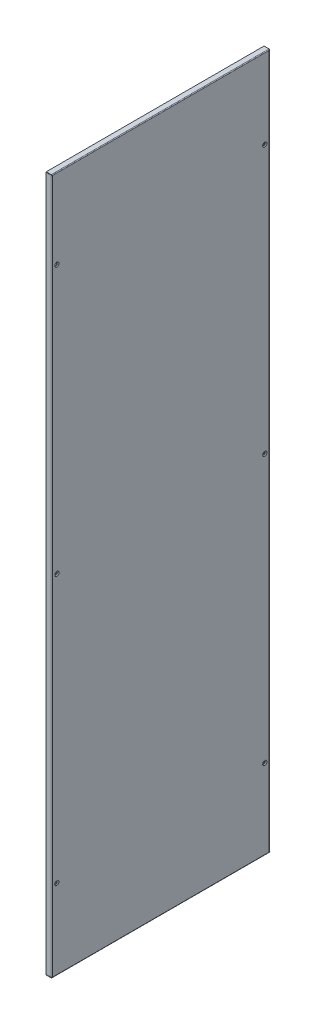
ISO-10303-21;
HEADER;
FILE_DESCRIPTION(('STEP AP214'),'2;1');
FILE_NAME('part.step','',(''),(''),'','','');
FILE_SCHEMA(('AUTOMOTIVE_DESIGN { 1 0 10303 214 1 1 1 1 }'));
ENDSEC;
DATA;
#1=APPLICATION_CONTEXT('core data for automotive mechanical design processes');
#2=APPLICATION_PROTOCOL_DEFINITION('international standard','automotive_design',2000,#1);
#3=PRODUCT_CONTEXT('',#1,'mechanical');
#4=PRODUCT('Part','Part','',(#3));
#5=PRODUCT_RELATED_PRODUCT_CATEGORY('part','',(#4));
#6=PRODUCT_DEFINITION_FORMATION('','',#4);
#7=PRODUCT_DEFINITION_CONTEXT('part definition',#1,'design');
#8=PRODUCT_DEFINITION('design','',#6,#7);
#9=PRODUCT_DEFINITION_SHAPE('','',#8);
#10=(LENGTH_UNIT() NAMED_UNIT(*) SI_UNIT(.MILLI.,.METRE.));
#11=(NAMED_UNIT(*) PLANE_ANGLE_UNIT() SI_UNIT($,.RADIAN.));
#12=(NAMED_UNIT(*) SI_UNIT($,.STERADIAN.) SOLID_ANGLE_UNIT());
#13=UNCERTAINTY_MEASURE_WITH_UNIT(LENGTH_MEASURE(1.E-05),#10,'distance_accuracy_value','');
#14=(GEOMETRIC_REPRESENTATION_CONTEXT(3) GLOBAL_UNCERTAINTY_ASSIGNED_CONTEXT((#13)) GLOBAL_UNIT_ASSIGNED_CONTEXT((#10,
#11,#12)) REPRESENTATION_CONTEXT('',''));
#15=CARTESIAN_POINT('',(0.,0.,0.));
#16=DIRECTION('',(0.,0.,1.));
#17=DIRECTION('',(1.,0.,0.));
#18=AXIS2_PLACEMENT_3D('',#15,#16,#17);
#19=CARTESIAN_POINT('',(-1.66533453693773E-13,981.999999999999,-307.499999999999));
#20=DIRECTION('',(-1.,0.,0.));
#21=DIRECTION('',(0.,0.,0.999999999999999));
#22=AXIS2_PLACEMENT_3D('',#19,#20,#21);
#23=PLANE('',#22);
#24=DIRECTION('',(0.,0.,-0.999999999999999));
#25=VECTOR('',#24,1.);
#26=CARTESIAN_POINT('',(-1.66533453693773E-13,979.949999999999,-307.499999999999));
#27=LINE('',#26,#25);
#28=CARTESIAN_POINT('',(-1.66533453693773E-13,979.949999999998,-305.45));
#29=VERTEX_POINT('',#28);
#30=CARTESIAN_POINT('',(0.,979.949999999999,305.45));
#31=VERTEX_POINT('',#30);
#32=EDGE_CURVE('E509',#29,#31,#27,.F.);
#33=ORIENTED_EDGE('',*,*,#32,.F.);
#34=DIRECTION('',(0.,-0.999999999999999,0.));
#35=VECTOR('',#34,1.);
#36=CARTESIAN_POINT('',(1.66533453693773E-13,-979.949999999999,-305.45));
#37=LINE('',#36,#35);
#38=CARTESIAN_POINT('',(1.66533453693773E-13,-979.949999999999,-305.45));
#39=VERTEX_POINT('',#38);
#40=EDGE_CURVE('E397',#39,#29,#37,.F.);
#41=ORIENTED_EDGE('',*,*,#40,.F.);
#42=DIRECTION('',(0.,0.,0.999999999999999));
#43=VECTOR('',#42,1.);
#44=CARTESIAN_POINT('',(2.91433543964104E-13,-979.949999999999,307.5));
#45=LINE('',#44,#43);
#46=CARTESIAN_POINT('',(2.91433543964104E-13,-979.949999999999,305.45));
#47=VERTEX_POINT('',#46);
#48=EDGE_CURVE('E499',#47,#39,#45,.F.);
#49=ORIENTED_EDGE('',*,*,#48,.F.);
#50=DIRECTION('',(0.,0.999999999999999,0.));
#51=VECTOR('',#50,1.);
#52=CARTESIAN_POINT('',(0.,979.949999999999,305.45));
#53=LINE('',#52,#51);
#54=EDGE_CURVE('E457',#31,#47,#53,.F.);
#55=ORIENTED_EDGE('',*,*,#54,.F.);
#56=EDGE_LOOP('',(#33,#41,#49,#55));
#57=FACE_BOUND('',#56,.T.);
#58=CARTESIAN_POINT('',(0.,755.999999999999,293.5));
#59=DIRECTION('',(-1.,0.,0.));
#60=DIRECTION('',(0.,0.,0.999999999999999));
#61=AXIS2_PLACEMENT_3D('',#58,#59,#60);
#62=CIRCLE('',#61,7.38035762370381);
#63=CARTESIAN_POINT('',(0.,755.999999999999,300.880357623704));
#64=VERTEX_POINT('',#63);
#65=EDGE_CURVE('E555',#64,#64,#62,.F.);
#66=ORIENTED_EDGE('',*,*,#65,.T.);
#67=EDGE_LOOP('',(#66));
#68=FACE_BOUND('',#67,.T.);
#69=CARTESIAN_POINT('',(1.80411241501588E-13,755.999999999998,-293.499999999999));
#70=DIRECTION('',(-1.,0.,0.));
#71=DIRECTION('',(0.,0.,0.999999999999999));
#72=AXIS2_PLACEMENT_3D('',#69,#70,#71);
#73=CIRCLE('',#72,7.38035762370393);
#74=CARTESIAN_POINT('',(1.80411241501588E-13,755.999999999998,-286.119642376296));
#75=VERTEX_POINT('',#74);
#76=EDGE_CURVE('E559',#75,#75,#73,.F.);
#77=ORIENTED_EDGE('',*,*,#76,.T.);
#78=EDGE_LOOP('',(#77));
#79=FACE_BOUND('',#78,.T.);
#80=CARTESIAN_POINT('',(0.,0.,293.5));
#81=DIRECTION('',(-1.,0.,0.));
#82=DIRECTION('',(0.,0.,0.999999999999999));
#83=AXIS2_PLACEMENT_3D('',#80,#81,#82);
#84=CIRCLE('',#83,7.38035762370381);
#85=CARTESIAN_POINT('',(0.,0.,300.880357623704));
#86=VERTEX_POINT('',#85);
#87=EDGE_CURVE('E564',#86,#86,#84,.F.);
#88=ORIENTED_EDGE('',*,*,#87,.T.);
#89=EDGE_LOOP('',(#88));
#90=FACE_BOUND('',#89,.T.);
#91=CARTESIAN_POINT('',(2.22044604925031E-13,-1.34137492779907E-12,-293.499999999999));
#92=DIRECTION('',(-1.,0.,0.));
#93=DIRECTION('',(0.,0.,0.999999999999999));
#94=AXIS2_PLACEMENT_3D('',#91,#92,#93);
#95=CIRCLE('',#94,7.38035762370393);
#96=CARTESIAN_POINT('',(2.22044604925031E-13,-1.34114615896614E-12,-286.119642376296));
#97=VERTEX_POINT('',#96);
#98=EDGE_CURVE('E569',#97,#97,#95,.F.);
#99=ORIENTED_EDGE('',*,*,#98,.T.);
#100=EDGE_LOOP('',(#99));
#101=FACE_BOUND('',#100,.T.);
#102=CARTESIAN_POINT('',(1.66533453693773E-13,-755.999999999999,293.5));
#103=DIRECTION('',(-1.,0.,0.));
#104=DIRECTION('',(0.,0.,0.999999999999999));
#105=AXIS2_PLACEMENT_3D('',#102,#103,#104);
#106=CIRCLE('',#105,7.38035762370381);
#107=CARTESIAN_POINT('',(1.66533453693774E-13,-755.999999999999,300.880357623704));
#108=VERTEX_POINT('',#107);
#109=EDGE_CURVE('E573',#108,#108,#106,.F.);
#110=ORIENTED_EDGE('',*,*,#109,.T.);
#111=EDGE_LOOP('',(#110));
#112=FACE_BOUND('',#111,.T.);
#113=CARTESIAN_POINT('',(2.63677968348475E-13,-756.000000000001,-293.499999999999));
#114=DIRECTION('',(-1.,0.,0.));
#115=DIRECTION('',(0.,0.,0.999999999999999));
#116=AXIS2_PLACEMENT_3D('',#113,#114,#115);
#117=CIRCLE('',#116,7.38035762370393);
#118=CARTESIAN_POINT('',(2.63677968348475E-13,-756.000000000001,-286.119642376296));
#119=VERTEX_POINT('',#118);
#120=EDGE_CURVE('E119',#119,#119,#117,.F.);
#121=ORIENTED_EDGE('',*,*,#120,.T.);
#122=EDGE_LOOP('',(#121));
#123=FACE_BOUND('',#122,.T.);
#124=ADVANCED_FACE('F116',(#57,#68,#79,#90,#101,#112,#123),#23,.T.);
#125=CARTESIAN_POINT('',(1.99999999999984,981.999999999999,-307.499999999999));
#126=DIRECTION('',(-1.,0.,0.));
#127=DIRECTION('',(0.,0.,0.999999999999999));
#128=AXIS2_PLACEMENT_3D('',#125,#126,#127);
#129=PLANE('',#128);
#130=CARTESIAN_POINT('',(1.99999999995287,-756.,293.5));
#131=DIRECTION('',(-1.,0.,0.));
#132=DIRECTION('',(0.,0.,0.999999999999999));
#133=AXIS2_PLACEMENT_3D('',#130,#131,#132);
#134=CIRCLE('',#133,6.);
#135=CARTESIAN_POINT('',(1.99999999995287,-756.,299.5));
#136=VERTEX_POINT('',#135);
#137=EDGE_CURVE('E575',#136,#136,#134,.T.);
#138=ORIENTED_EDGE('',*,*,#137,.T.);
#139=EDGE_LOOP('',(#138));
#140=FACE_BOUND('',#139,.T.);
#141=CARTESIAN_POINT('',(1.99999999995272,0.,293.5));
#142=DIRECTION('',(-1.,0.,0.));
#143=DIRECTION('',(0.,0.,0.999999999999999));
#144=AXIS2_PLACEMENT_3D('',#141,#142,#143);
#145=CIRCLE('',#144,6.);
#146=CARTESIAN_POINT('',(1.99999999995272,0.,299.5));
#147=VERTEX_POINT('',#146);
#148=EDGE_CURVE('E567',#147,#147,#145,.T.);
#149=ORIENTED_EDGE('',*,*,#148,.T.);
#150=EDGE_LOOP('',(#149));
#151=FACE_BOUND('',#150,.T.);
#152=CARTESIAN_POINT('',(1.99999999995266,755.999999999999,293.5));
#153=DIRECTION('',(-1.,0.,0.));
#154=DIRECTION('',(0.,0.,0.999999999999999));
#155=AXIS2_PLACEMENT_3D('',#152,#153,#154);
#156=CIRCLE('',#155,6.);
#157=CARTESIAN_POINT('',(1.99999999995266,755.999999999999,299.5));
#158=VERTEX_POINT('',#157);
#159=EDGE_CURVE('E379',#158,#158,#156,.T.);
#160=ORIENTED_EDGE('',*,*,#159,.T.);
#161=EDGE_LOOP('',(#160));
#162=FACE_BOUND('',#161,.T.);
#163=DIRECTION('',(0.,-0.999999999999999,0.));
#164=VECTOR('',#163,1.);
#165=CARTESIAN_POINT('',(2.00000000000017,-979.949999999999,-305.45));
#166=LINE('',#165,#164);
#167=CARTESIAN_POINT('',(2.00000000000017,-979.95,-305.45));
#168=VERTEX_POINT('',#167);
#169=CARTESIAN_POINT('',(1.99999999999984,979.949999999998,-305.45));
#170=VERTEX_POINT('',#169);
#171=EDGE_CURVE('E380',#168,#170,#166,.F.);
#172=ORIENTED_EDGE('',*,*,#171,.T.);
#173=DIRECTION('',(0.,0.,-0.999999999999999));
#174=VECTOR('',#173,1.);
#175=CARTESIAN_POINT('',(1.99999999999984,979.949999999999,-307.499999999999));
#176=LINE('',#175,#174);
#177=CARTESIAN_POINT('',(1.99999999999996,979.949999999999,305.45));
#178=VERTEX_POINT('',#177);
#179=EDGE_CURVE('E1425',#170,#178,#176,.F.);
#180=ORIENTED_EDGE('',*,*,#179,.T.);
#181=DIRECTION('',(0.,0.999999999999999,0.));
#182=VECTOR('',#181,1.);
#183=CARTESIAN_POINT('',(1.99999999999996,979.949999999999,305.45));
#184=LINE('',#183,#182);
#185=CARTESIAN_POINT('',(2.00000000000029,-979.949999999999,305.45));
#186=VERTEX_POINT('',#185);
#187=EDGE_CURVE('E440',#178,#186,#184,.F.);
#188=ORIENTED_EDGE('',*,*,#187,.T.);
#189=DIRECTION('',(0.,0.,0.999999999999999));
#190=VECTOR('',#189,1.);
#191=CARTESIAN_POINT('',(2.00000000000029,-979.95,307.5));
#192=LINE('',#191,#190);
#193=EDGE_CURVE('E495',#186,#168,#192,.F.);
#194=ORIENTED_EDGE('',*,*,#193,.T.);
#195=EDGE_LOOP('',(#172,#180,#188,#194));
#196=FACE_BOUND('',#195,.T.);
#197=CARTESIAN_POINT('',(1.99999999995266,755.999999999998,-293.499999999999));
#198=DIRECTION('',(-1.,0.,0.));
#199=DIRECTION('',(0.,0.,0.999999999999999));
#200=AXIS2_PLACEMENT_3D('',#197,#198,#199);
#201=CIRCLE('',#200,6.);
#202=CARTESIAN_POINT('',(1.99999999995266,755.999999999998,-287.499999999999));
#203=VERTEX_POINT('',#202);
#204=EDGE_CURVE('E562',#203,#203,#201,.T.);
#205=ORIENTED_EDGE('',*,*,#204,.T.);
#206=EDGE_LOOP('',(#205));
#207=FACE_BOUND('',#206,.T.);
#208=CARTESIAN_POINT('',(1.99999999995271,-1.34137492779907E-12,-293.499999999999));
#209=DIRECTION('',(-1.,0.,0.));
#210=DIRECTION('',(0.,0.,0.999999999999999));
#211=AXIS2_PLACEMENT_3D('',#208,#209,#210);
#212=CIRCLE('',#211,6.);
#213=CARTESIAN_POINT('',(1.99999999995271,-1.34118894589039E-12,-287.499999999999));
#214=VERTEX_POINT('',#213);
#215=EDGE_CURVE('E571',#214,#214,#212,.T.);
#216=ORIENTED_EDGE('',*,*,#215,.T.);
#217=EDGE_LOOP('',(#216));
#218=FACE_BOUND('',#217,.T.);
#219=CARTESIAN_POINT('',(1.99999999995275,-756.000000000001,-293.499999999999));
#220=DIRECTION('',(-1.,0.,0.));
#221=DIRECTION('',(0.,0.,0.999999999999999));
#222=AXIS2_PLACEMENT_3D('',#219,#220,#221);
#223=CIRCLE('',#222,6.);
#224=CARTESIAN_POINT('',(1.99999999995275,-756.000000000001,-287.499999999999));
#225=VERTEX_POINT('',#224);
#226=EDGE_CURVE('E588',#225,#225,#223,.T.);
#227=ORIENTED_EDGE('',*,*,#226,.T.);
#228=EDGE_LOOP('',(#227));
#229=FACE_BOUND('',#228,.T.);
#230=ADVANCED_FACE('F805',(#140,#151,#162,#196,#207,#218,#229),#129,.F.);
#231=CARTESIAN_POINT('',(1.66533453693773E-13,-979.949999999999,-307.499999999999));
#232=DIRECTION('',(0.,0.999999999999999,0.));
#233=DIRECTION('',(0.,0.,0.999999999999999));
#234=AXIS2_PLACEMENT_3D('',#231,#232,#233);
#235=PLANE('',#234);
#236=DIRECTION('',(1.,0.,0.));
#237=VECTOR('',#236,1.);
#238=CARTESIAN_POINT('',(1.66533453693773E-13,-979.949999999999,-307.499999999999));
#239=LINE('',#238,#237);
#240=CARTESIAN_POINT('',(-1.48654675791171E-05,-979.949999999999,-307.499390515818));
#241=VERTEX_POINT('',#240);
#242=CARTESIAN_POINT('',(2.00000000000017,-979.95,-307.499999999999));
#243=VERTEX_POINT('',#242);
#244=EDGE_CURVE('E513',#241,#243,#239,.T.);
#245=ORIENTED_EDGE('',*,*,#244,.F.);
#246=CARTESIAN_POINT('',(-0.0499999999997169,-979.949999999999,-305.45));
#247=DIRECTION('',(0.,-0.999999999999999,0.));
#248=DIRECTION('',(0.,0.,-0.999999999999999));
#249=AXIS2_PLACEMENT_3D('',#246,#247,#248);
#250=CIRCLE('',#249,2.04999999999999);
#251=EDGE_CURVE('E13',#241,#168,#250,.T.);
#252=ORIENTED_EDGE('',*,*,#251,.T.);
#253=DIRECTION('',(0.,0.,0.999999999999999));
#254=VECTOR('',#253,1.);
#255=CARTESIAN_POINT('',(2.00000000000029,-979.949999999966,307.5));
#256=LINE('',#255,#254);
#257=EDGE_CURVE('E463',#243,#168,#256,.T.);
#258=ORIENTED_EDGE('',*,*,#257,.F.);
#259=EDGE_LOOP('',(#245,#252,#258));
#260=FACE_BOUND('',#259,.T.);
#261=ADVANCED_FACE('F801',(#260),#235,.T.);
#262=CARTESIAN_POINT('',(-1.66533453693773E-13,979.949999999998,-305.45));
#263=DIRECTION('',(0.,-0.999999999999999,-2.16659879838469E-13));
#264=DIRECTION('',(0.,2.1659788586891E-13,-0.999999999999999));
#265=AXIS2_PLACEMENT_3D('',#262,#263,#264);
#266=PLANE('',#265);
#267=CARTESIAN_POINT('',(1.99999999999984,979.949999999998,-307.499999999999));
#268=VERTEX_POINT('',#267);
#269=EDGE_CURVE('E1428',#268,#170,#176,.F.);
#270=ORIENTED_EDGE('',*,*,#269,.T.);
#271=CARTESIAN_POINT('',(-0.050000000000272,979.949999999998,-305.45));
#272=DIRECTION('',(0.,-0.999999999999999,0.));
#273=DIRECTION('',(0.,0.,-0.999999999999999));
#274=AXIS2_PLACEMENT_3D('',#271,#272,#273);
#275=CIRCLE('',#274,2.04999999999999);
#276=CARTESIAN_POINT('',(-1.48654681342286E-05,979.949999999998,-307.499390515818));
#277=VERTEX_POINT('',#276);
#278=EDGE_CURVE('E391',#170,#277,#275,.F.);
#279=ORIENTED_EDGE('',*,*,#278,.T.);
#280=DIRECTION('',(1.,0.,0.));
#281=VECTOR('',#280,1.);
#282=CARTESIAN_POINT('',(-1.66533453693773E-13,979.949999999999,-307.499999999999));
#283=LINE('',#282,#281);
#284=EDGE_CURVE('E522',#277,#268,#283,.T.);
#285=ORIENTED_EDGE('',*,*,#284,.T.);
#286=EDGE_LOOP('',(#270,#279,#285));
#287=FACE_BOUND('',#286,.T.);
#288=ADVANCED_FACE('F797',(#287),#266,.T.);
#289=CARTESIAN_POINT('',(0.,979.949999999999,307.5));
#290=DIRECTION('',(0.,-0.999999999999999,0.));
#291=DIRECTION('',(0.,0.,-0.999999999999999));
#292=AXIS2_PLACEMENT_3D('',#289,#290,#291);
#293=PLANE('',#292);
#294=DIRECTION('',(1.,0.,0.));
#295=VECTOR('',#294,1.);
#296=CARTESIAN_POINT('',(0.,979.949999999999,307.5));
#297=LINE('',#296,#295);
#298=CARTESIAN_POINT('',(-1.48654678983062E-05,979.949999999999,307.499390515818));
#299=VERTEX_POINT('',#298);
#300=CARTESIAN_POINT('',(1.99999999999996,979.949999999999,307.5));
#301=VERTEX_POINT('',#300);
#302=EDGE_CURVE('E520',#299,#301,#297,.T.);
#303=ORIENTED_EDGE('',*,*,#302,.F.);
#304=CARTESIAN_POINT('',(-0.0500000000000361,979.949999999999,305.45));
#305=DIRECTION('',(0.,0.999999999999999,0.));
#306=DIRECTION('',(0.,0.,0.999999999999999));
#307=AXIS2_PLACEMENT_3D('',#304,#305,#306);
#308=CIRCLE('',#307,2.04999999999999);
#309=EDGE_CURVE('E124',#299,#178,#308,.T.);
#310=ORIENTED_EDGE('',*,*,#309,.T.);
#311=DIRECTION('',(0.,0.,-0.999999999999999));
#312=VECTOR('',#311,1.);
#313=CARTESIAN_POINT('',(1.99999999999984,979.949999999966,-307.499999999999));
#314=LINE('',#313,#312);
#315=EDGE_CURVE('E238',#301,#178,#314,.T.);
#316=ORIENTED_EDGE('',*,*,#315,.F.);
#317=EDGE_LOOP('',(#303,#310,#316));
#318=FACE_BOUND('',#317,.T.);
#319=ADVANCED_FACE('F800',(#318),#293,.T.);
#320=CARTESIAN_POINT('',(2.91433543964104E-13,-979.949999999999,305.45));
#321=DIRECTION('',(0.,0.999999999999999,2.16659879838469E-13));
#322=DIRECTION('',(0.,-2.1659788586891E-13,0.999999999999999));
#323=AXIS2_PLACEMENT_3D('',#320,#321,#322);
#324=PLANE('',#323);
#325=CARTESIAN_POINT('',(2.00000000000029,-979.95,307.5));
#326=VERTEX_POINT('',#325);
#327=EDGE_CURVE('E492',#326,#186,#192,.F.);
#328=ORIENTED_EDGE('',*,*,#327,.T.);
#329=CARTESIAN_POINT('',(-0.0499999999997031,-979.949999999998,305.45));
#330=DIRECTION('',(0.,0.999999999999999,0.));
#331=DIRECTION('',(0.,0.,0.999999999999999));
#332=AXIS2_PLACEMENT_3D('',#329,#330,#331);
#333=CIRCLE('',#332,2.04999999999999);
#334=CARTESIAN_POINT('',(-1.48654675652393E-05,-979.949999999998,307.499390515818));
#335=VERTEX_POINT('',#334);
#336=EDGE_CURVE('E451',#186,#335,#333,.F.);
#337=ORIENTED_EDGE('',*,*,#336,.T.);
#338=DIRECTION('',(1.,0.,0.));
#339=VECTOR('',#338,1.);
#340=CARTESIAN_POINT('',(2.91433543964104E-13,-979.949999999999,307.5));
#341=LINE('',#340,#339);
#342=EDGE_CURVE('E246',#335,#326,#341,.T.);
#343=ORIENTED_EDGE('',*,*,#342,.T.);
#344=EDGE_LOOP('',(#328,#337,#343));
#345=FACE_BOUND('',#344,.T.);
#346=ADVANCED_FACE('F807',(#345),#324,.T.);
#347=CARTESIAN_POINT('',(-0.0500000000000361,979.949999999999,307.5));
#348=DIRECTION('',(0.,0.,0.999999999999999));
#349=DIRECTION('',(1.,0.,0.));
#350=AXIS2_PLACEMENT_3D('',#347,#348,#349);
#351=PLANE('',#350);
#352=DIRECTION('',(0.,0.999999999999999,0.));
#353=VECTOR('',#352,1.);
#354=CARTESIAN_POINT('',(-0.0500000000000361,981.999999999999,307.5));
#355=LINE('',#354,#353);
#356=CARTESIAN_POINT('',(-0.0500000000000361,979.999999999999,307.5));
#357=VERTEX_POINT('',#356);
#358=CARTESIAN_POINT('',(-0.0500000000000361,981.999999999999,307.5));
#359=VERTEX_POINT('',#358);
#360=EDGE_CURVE('E154',#357,#359,#355,.T.);
#361=ORIENTED_EDGE('',*,*,#360,.F.);
#362=CARTESIAN_POINT('',(-0.0500000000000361,979.949999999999,307.5));
#363=DIRECTION('',(0.,0.,-0.999999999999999));
#364=DIRECTION('',(-1.,0.,0.));
#365=AXIS2_PLACEMENT_3D('',#362,#363,#364);
#366=CIRCLE('',#365,0.0499999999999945);
#367=EDGE_CURVE('E528',#299,#357,#366,.F.);
#368=ORIENTED_EDGE('',*,*,#367,.F.);
#369=ORIENTED_EDGE('',*,*,#302,.T.);
#370=CARTESIAN_POINT('',(-0.0500000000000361,979.949999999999,307.5));
#371=DIRECTION('',(0.,0.,-0.999999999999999));
#372=DIRECTION('',(-1.,0.,0.));
#373=AXIS2_PLACEMENT_3D('',#370,#371,#372);
#374=CIRCLE('',#373,2.04999999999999);
#375=EDGE_CURVE('E537',#301,#359,#374,.F.);
#376=ORIENTED_EDGE('',*,*,#375,.T.);
#377=EDGE_LOOP('',(#361,#368,#369,#376));
#378=FACE_BOUND('',#377,.T.);
#379=ADVANCED_FACE('F810',(#378),#351,.T.);
#380=CARTESIAN_POINT('',(-0.050000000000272,979.949999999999,-307.499999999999));
#381=DIRECTION('',(0.,0.,0.999999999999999));
#382=DIRECTION('',(1.,0.,0.));
#383=AXIS2_PLACEMENT_3D('',#380,#381,#382);
#384=PLANE('',#383);
#385=CARTESIAN_POINT('',(-0.050000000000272,979.949999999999,-307.499999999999));
#386=DIRECTION('',(0.,0.,-0.999999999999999));
#387=DIRECTION('',(-1.,0.,0.));
#388=AXIS2_PLACEMENT_3D('',#385,#386,#387);
#389=CIRCLE('',#388,0.0499999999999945);
#390=CARTESIAN_POINT('',(-0.050000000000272,979.999999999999,-307.499999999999));
#391=VERTEX_POINT('',#390);
#392=EDGE_CURVE('E540',#391,#277,#389,.T.);
#393=ORIENTED_EDGE('',*,*,#392,.F.);
#394=DIRECTION('',(0.,0.999999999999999,0.));
#395=VECTOR('',#394,1.);
#396=CARTESIAN_POINT('',(-0.050000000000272,979.999999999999,-307.499999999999));
#397=LINE('',#396,#395);
#398=CARTESIAN_POINT('',(-0.050000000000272,981.999999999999,-307.499999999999));
#399=VERTEX_POINT('',#398);
#400=EDGE_CURVE('E1453',#391,#399,#397,.T.);
#401=ORIENTED_EDGE('',*,*,#400,.T.);
#402=CARTESIAN_POINT('',(-0.050000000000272,979.949999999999,-307.499999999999));
#403=DIRECTION('',(0.,0.,-0.999999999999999));
#404=DIRECTION('',(-1.,0.,0.));
#405=AXIS2_PLACEMENT_3D('',#402,#403,#404);
#406=CIRCLE('',#405,2.04999999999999);
#407=EDGE_CURVE('E160',#399,#268,#406,.T.);
#408=ORIENTED_EDGE('',*,*,#407,.T.);
#409=ORIENTED_EDGE('',*,*,#284,.F.);
#410=EDGE_LOOP('',(#393,#401,#408,#409));
#411=FACE_BOUND('',#410,.T.);
#412=ADVANCED_FACE('F866',(#411),#384,.F.);
#413=CARTESIAN_POINT('',(-0.050000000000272,979.949999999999,-307.499999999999));
#414=DIRECTION('',(0.,0.,-0.999999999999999));
#415=DIRECTION('',(0.,0.999999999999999,0.));
#416=AXIS2_PLACEMENT_3D('',#413,#414,#415);
#417=CYLINDRICAL_SURFACE('',#416,2.04999999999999);
#418=ORIENTED_EDGE('',*,*,#269,.F.);
#419=ORIENTED_EDGE('',*,*,#407,.F.);
#420=DIRECTION('',(0.,0.,-0.999999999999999));
#421=VECTOR('',#420,1.);
#422=CARTESIAN_POINT('',(-0.050000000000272,981.999999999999,-307.499999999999));
#423=LINE('',#422,#421);
#424=EDGE_CURVE('E141',#359,#399,#423,.T.);
#425=ORIENTED_EDGE('',*,*,#424,.F.);
#426=ORIENTED_EDGE('',*,*,#375,.F.);
#427=ORIENTED_EDGE('',*,*,#315,.T.);
#428=ORIENTED_EDGE('',*,*,#179,.F.);
#429=EDGE_LOOP('',(#418,#419,#425,#426,#427,#428));
#430=FACE_BOUND('',#429,.T.);
#431=ADVANCED_FACE('F863',(#430),#417,.T.);
#432=CARTESIAN_POINT('',(-0.050000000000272,979.949999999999,-307.499999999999));
#433=DIRECTION('',(0.,0.,-0.999999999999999));
#434=DIRECTION('',(0.,0.999999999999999,0.));
#435=AXIS2_PLACEMENT_3D('',#432,#433,#434);
#436=CYLINDRICAL_SURFACE('',#435,0.0499999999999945);
#437=EDGE_CURVE('E530',#277,#29,#27,.F.);
#438=ORIENTED_EDGE('',*,*,#437,.T.);
#439=ORIENTED_EDGE('',*,*,#32,.T.);
#440=DIRECTION('',(0.,0.,-0.999999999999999));
#441=VECTOR('',#440,1.);
#442=CARTESIAN_POINT('',(0.,979.949999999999,307.5));
#443=LINE('',#442,#441);
#444=EDGE_CURVE('E466',#299,#31,#443,.T.);
#445=ORIENTED_EDGE('',*,*,#444,.F.);
#446=ORIENTED_EDGE('',*,*,#367,.T.);
#447=DIRECTION('',(0.,0.,0.999999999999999));
#448=VECTOR('',#447,1.);
#449=CARTESIAN_POINT('',(-0.0500000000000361,979.999999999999,307.5));
#450=LINE('',#449,#448);
#451=EDGE_CURVE('E1436',#357,#391,#450,.F.);
#452=ORIENTED_EDGE('',*,*,#451,.T.);
#453=ORIENTED_EDGE('',*,*,#392,.T.);
#454=EDGE_LOOP('',(#438,#439,#445,#446,#452,#453));
#455=FACE_BOUND('',#454,.T.);
#456=ADVANCED_FACE('F856',(#455),#436,.F.);
#457=CARTESIAN_POINT('',(-1.66533453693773E-13,981.999999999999,-307.499999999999));
#458=DIRECTION('',(0.,0.,-0.999999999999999));
#459=DIRECTION('',(-1.,0.,0.));
#460=AXIS2_PLACEMENT_3D('',#457,#458,#459);
#461=PLANE('',#460);
#462=DIRECTION('',(1.,0.,0.));
#463=VECTOR('',#462,1.);
#464=CARTESIAN_POINT('',(-1.66533453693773E-13,981.999999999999,-307.499999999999));
#465=LINE('',#464,#463);
#466=CARTESIAN_POINT('',(-14.0000000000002,981.999999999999,-307.499999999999));
#467=VERTEX_POINT('',#466);
#468=EDGE_CURVE('E1443',#467,#399,#465,.T.);
#469=ORIENTED_EDGE('',*,*,#468,.T.);
#470=ORIENTED_EDGE('',*,*,#400,.F.);
#471=DIRECTION('',(-1.,0.,0.));
#472=VECTOR('',#471,1.);
#473=CARTESIAN_POINT('',(-1.66533453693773E-13,979.999999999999,-307.499999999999));
#474=LINE('',#473,#472);
#475=CARTESIAN_POINT('',(-14.0000000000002,979.999999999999,-307.499999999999));
#476=VERTEX_POINT('',#475);
#477=EDGE_CURVE('E1441',#476,#391,#474,.F.);
#478=ORIENTED_EDGE('',*,*,#477,.F.);
#479=DIRECTION('',(0.,-0.999999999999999,0.));
#480=VECTOR('',#479,1.);
#481=CARTESIAN_POINT('',(-14.0000000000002,981.999999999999,-307.499999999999));
#482=LINE('',#481,#480);
#483=EDGE_CURVE('E175',#467,#476,#482,.T.);
#484=ORIENTED_EDGE('',*,*,#483,.F.);
#485=EDGE_LOOP('',(#469,#470,#478,#484));
#486=FACE_BOUND('',#485,.T.);
#487=ADVANCED_FACE('F853',(#486),#461,.T.);
#488=CARTESIAN_POINT('',(-14.0000000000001,981.999999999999,307.5));
#489=DIRECTION('',(0.,0.,0.999999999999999));
#490=DIRECTION('',(1.,0.,0.));
#491=AXIS2_PLACEMENT_3D('',#488,#489,#490);
#492=PLANE('',#491);
#493=DIRECTION('',(1.,0.,0.));
#494=VECTOR('',#493,1.);
#495=CARTESIAN_POINT('',(-2.48412401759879E-12,979.999999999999,307.5));
#496=LINE('',#495,#494);
#497=CARTESIAN_POINT('',(-14.0000000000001,979.999999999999,307.5));
#498=VERTEX_POINT('',#497);
#499=EDGE_CURVE('E182',#357,#498,#496,.F.);
#500=ORIENTED_EDGE('',*,*,#499,.F.);
#501=ORIENTED_EDGE('',*,*,#360,.T.);
#502=DIRECTION('',(-1.,0.,0.));
#503=VECTOR('',#502,1.);
#504=CARTESIAN_POINT('',(-14.0000000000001,981.999999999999,307.5));
#505=LINE('',#504,#503);
#506=CARTESIAN_POINT('',(-14.0000000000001,981.999999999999,307.5));
#507=VERTEX_POINT('',#506);
#508=EDGE_CURVE('E1434',#359,#507,#505,.T.);
#509=ORIENTED_EDGE('',*,*,#508,.T.);
#510=DIRECTION('',(0.,-0.999999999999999,0.));
#511=VECTOR('',#510,1.);
#512=CARTESIAN_POINT('',(-14.0000000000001,981.999999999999,307.5));
#513=LINE('',#512,#511);
#514=EDGE_CURVE('E1459',#507,#498,#513,.T.);
#515=ORIENTED_EDGE('',*,*,#514,.T.);
#516=EDGE_LOOP('',(#500,#501,#509,#515));
#517=FACE_BOUND('',#516,.T.);
#518=ADVANCED_FACE('F849',(#517),#492,.T.);
#519=CARTESIAN_POINT('',(-1.66533453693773E-13,981.999999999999,-307.499999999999));
#520=DIRECTION('',(0.,0.999999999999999,0.));
#521=DIRECTION('',(0.,0.,0.999999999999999));
#522=AXIS2_PLACEMENT_3D('',#519,#520,#521);
#523=PLANE('',#522);
#524=ORIENTED_EDGE('',*,*,#508,.F.);
#525=ORIENTED_EDGE('',*,*,#424,.T.);
#526=ORIENTED_EDGE('',*,*,#468,.F.);
#527=DIRECTION('',(0.,0.,-0.999999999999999));
#528=VECTOR('',#527,1.);
#529=CARTESIAN_POINT('',(-14.0000000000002,981.999999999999,-307.499999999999));
#530=LINE('',#529,#528);
#531=EDGE_CURVE('E1440',#507,#467,#530,.T.);
#532=ORIENTED_EDGE('',*,*,#531,.F.);
#533=EDGE_LOOP('',(#524,#525,#526,#532));
#534=FACE_BOUND('',#533,.T.);
#535=ADVANCED_FACE('F845',(#534),#523,.T.);
#536=CARTESIAN_POINT('',(-1.66533453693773E-13,979.999999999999,-307.499999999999));
#537=DIRECTION('',(0.,0.999999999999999,0.));
#538=DIRECTION('',(0.,0.,0.999999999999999));
#539=AXIS2_PLACEMENT_3D('',#536,#537,#538);
#540=PLANE('',#539);
#541=ORIENTED_EDGE('',*,*,#451,.F.);
#542=ORIENTED_EDGE('',*,*,#499,.T.);
#543=DIRECTION('',(0.,0.,0.999999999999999));
#544=VECTOR('',#543,1.);
#545=CARTESIAN_POINT('',(-14.0000000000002,979.999999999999,-307.499999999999));
#546=LINE('',#545,#544);
#547=EDGE_CURVE('E1446',#498,#476,#546,.F.);
#548=ORIENTED_EDGE('',*,*,#547,.T.);
#549=ORIENTED_EDGE('',*,*,#477,.T.);
#550=EDGE_LOOP('',(#541,#542,#548,#549));
#551=FACE_BOUND('',#550,.T.);
#552=ADVANCED_FACE('F848',(#551),#540,.F.);
#553=CARTESIAN_POINT('',(-14.0000000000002,981.999999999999,-307.499999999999));
#554=DIRECTION('',(-1.,0.,0.));
#555=DIRECTION('',(0.,-0.999999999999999,0.));
#556=AXIS2_PLACEMENT_3D('',#553,#554,#555);
#557=PLANE('',#556);
#558=ORIENTED_EDGE('',*,*,#547,.F.);
#559=ORIENTED_EDGE('',*,*,#514,.F.);
#560=ORIENTED_EDGE('',*,*,#531,.T.);
#561=ORIENTED_EDGE('',*,*,#483,.T.);
#562=EDGE_LOOP('',(#558,#559,#560,#561));
#563=FACE_BOUND('',#562,.T.);
#564=ADVANCED_FACE('F841',(#563),#557,.T.);
#565=CARTESIAN_POINT('',(-0.0499999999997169,-979.949999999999,-307.499999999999));
#566=DIRECTION('',(0.,0.,-0.999999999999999));
#567=DIRECTION('',(-1.,0.,0.));
#568=AXIS2_PLACEMENT_3D('',#565,#566,#567);
#569=PLANE('',#568);
#570=DIRECTION('',(0.,-0.999999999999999,0.));
#571=VECTOR('',#570,1.);
#572=CARTESIAN_POINT('',(-0.0499999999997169,-981.999999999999,-307.499999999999));
#573=LINE('',#572,#571);
#574=CARTESIAN_POINT('',(-0.0499999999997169,-979.999999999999,-307.499999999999));
#575=VERTEX_POINT('',#574);
#576=CARTESIAN_POINT('',(-0.0499999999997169,-981.999999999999,-307.499999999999));
#577=VERTEX_POINT('',#576);
#578=EDGE_CURVE('E202',#575,#577,#573,.T.);
#579=ORIENTED_EDGE('',*,*,#578,.F.);
#580=CARTESIAN_POINT('',(-0.0499999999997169,-979.949999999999,-307.499999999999));
#581=DIRECTION('',(0.,0.,0.999999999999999));
#582=DIRECTION('',(1.,0.,0.));
#583=AXIS2_PLACEMENT_3D('',#580,#581,#582);
#584=CIRCLE('',#583,0.0499999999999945);
#585=EDGE_CURVE('E498',#241,#575,#584,.F.);
#586=ORIENTED_EDGE('',*,*,#585,.F.);
#587=ORIENTED_EDGE('',*,*,#244,.T.);
#588=CARTESIAN_POINT('',(-0.0499999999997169,-979.949999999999,-307.499999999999));
#589=DIRECTION('',(0.,0.,0.999999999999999));
#590=DIRECTION('',(1.,0.,0.));
#591=AXIS2_PLACEMENT_3D('',#588,#589,#590);
#592=CIRCLE('',#591,2.04999999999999);
#593=EDGE_CURVE('E494',#243,#577,#592,.F.);
#594=ORIENTED_EDGE('',*,*,#593,.T.);
#595=EDGE_LOOP('',(#579,#586,#587,#594));
#596=FACE_BOUND('',#595,.T.);
#597=ADVANCED_FACE('F835',(#596),#569,.T.);
#598=CARTESIAN_POINT('',(-0.0499999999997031,-979.949999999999,307.5));
#599=DIRECTION('',(0.,0.,-0.999999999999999));
#600=DIRECTION('',(-1.,0.,0.));
#601=AXIS2_PLACEMENT_3D('',#598,#599,#600);
#602=PLANE('',#601);
#603=CARTESIAN_POINT('',(-0.0499999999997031,-979.949999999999,307.5));
#604=DIRECTION('',(0.,0.,0.999999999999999));
#605=DIRECTION('',(1.,0.,0.));
#606=AXIS2_PLACEMENT_3D('',#603,#604,#605);
#607=CIRCLE('',#606,0.0499999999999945);
#608=CARTESIAN_POINT('',(-0.0499999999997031,-979.999999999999,307.5));
#609=VERTEX_POINT('',#608);
#610=EDGE_CURVE('E470',#609,#335,#607,.T.);
#611=ORIENTED_EDGE('',*,*,#610,.F.);
#612=DIRECTION('',(0.,-0.999999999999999,0.));
#613=VECTOR('',#612,1.);
#614=CARTESIAN_POINT('',(-0.0499999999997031,-979.999999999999,307.5));
#615=LINE('',#614,#613);
#616=CARTESIAN_POINT('',(-0.0499999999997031,-981.999999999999,307.5));
#617=VERTEX_POINT('',#616);
#618=EDGE_CURVE('E487',#609,#617,#615,.T.);
#619=ORIENTED_EDGE('',*,*,#618,.T.);
#620=CARTESIAN_POINT('',(-0.0499999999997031,-979.949999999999,307.5));
#621=DIRECTION('',(0.,0.,0.999999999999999));
#622=DIRECTION('',(1.,0.,0.));
#623=AXIS2_PLACEMENT_3D('',#620,#621,#622);
#624=CIRCLE('',#623,2.04999999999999);
#625=EDGE_CURVE('E230',#617,#326,#624,.T.);
#626=ORIENTED_EDGE('',*,*,#625,.T.);
#627=ORIENTED_EDGE('',*,*,#342,.F.);
#628=EDGE_LOOP('',(#611,#619,#626,#627));
#629=FACE_BOUND('',#628,.T.);
#630=ADVANCED_FACE('F834',(#629),#602,.F.);
#631=CARTESIAN_POINT('',(-0.0499999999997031,-979.949999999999,307.5));
#632=DIRECTION('',(0.,0.,0.999999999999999));
#633=DIRECTION('',(0.,-0.999999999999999,0.));
#634=AXIS2_PLACEMENT_3D('',#631,#632,#633);
#635=CYLINDRICAL_SURFACE('',#634,2.04999999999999);
#636=ORIENTED_EDGE('',*,*,#327,.F.);
#637=ORIENTED_EDGE('',*,*,#625,.F.);
#638=DIRECTION('',(0.,0.,0.999999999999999));
#639=VECTOR('',#638,1.);
#640=CARTESIAN_POINT('',(-0.0499999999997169,-981.999999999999,-307.499999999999));
#641=LINE('',#640,#639);
#642=EDGE_CURVE('E190',#617,#577,#641,.F.);
#643=ORIENTED_EDGE('',*,*,#642,.T.);
#644=ORIENTED_EDGE('',*,*,#593,.F.);
#645=ORIENTED_EDGE('',*,*,#257,.T.);
#646=ORIENTED_EDGE('',*,*,#193,.F.);
#647=EDGE_LOOP('',(#636,#637,#643,#644,#645,#646));
#648=FACE_BOUND('',#647,.T.);
#649=ADVANCED_FACE('F831',(#648),#635,.T.);
#650=CARTESIAN_POINT('',(-0.0499999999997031,-979.949999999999,307.5));
#651=DIRECTION('',(0.,0.,0.999999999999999));
#652=DIRECTION('',(0.,-0.999999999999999,0.));
#653=AXIS2_PLACEMENT_3D('',#650,#651,#652);
#654=CYLINDRICAL_SURFACE('',#653,0.0499999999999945);
#655=EDGE_CURVE('E503',#335,#47,#45,.F.);
#656=ORIENTED_EDGE('',*,*,#655,.T.);
#657=ORIENTED_EDGE('',*,*,#48,.T.);
#658=DIRECTION('',(0.,0.,0.999999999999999));
#659=VECTOR('',#658,1.);
#660=CARTESIAN_POINT('',(1.66533453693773E-13,-979.949999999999,-307.499999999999));
#661=LINE('',#660,#659);
#662=EDGE_CURVE('E467',#241,#39,#661,.T.);
#663=ORIENTED_EDGE('',*,*,#662,.F.);
#664=ORIENTED_EDGE('',*,*,#585,.T.);
#665=DIRECTION('',(0.,0.,0.999999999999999));
#666=VECTOR('',#665,1.);
#667=CARTESIAN_POINT('',(-0.0499999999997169,-979.999999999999,-307.499999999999));
#668=LINE('',#667,#666);
#669=EDGE_CURVE('E489',#575,#609,#668,.T.);
#670=ORIENTED_EDGE('',*,*,#669,.T.);
#671=ORIENTED_EDGE('',*,*,#610,.T.);
#672=EDGE_LOOP('',(#656,#657,#663,#664,#670,#671));
#673=FACE_BOUND('',#672,.T.);
#674=ADVANCED_FACE('F829',(#673),#654,.F.);
#675=CARTESIAN_POINT('',(1.66533453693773E-13,-981.999999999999,-307.499999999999));
#676=DIRECTION('',(0.,0.,-0.999999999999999));
#677=DIRECTION('',(-1.,0.,0.));
#678=AXIS2_PLACEMENT_3D('',#675,#676,#677);
#679=PLANE('',#678);
#680=DIRECTION('',(-1.,0.,0.));
#681=VECTOR('',#680,1.);
#682=CARTESIAN_POINT('',(-13.9999999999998,-980.,-307.499999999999));
#683=LINE('',#682,#681);
#684=CARTESIAN_POINT('',(-13.9999999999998,-980.,-307.499999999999));
#685=VERTEX_POINT('',#684);
#686=EDGE_CURVE('E226',#575,#685,#683,.T.);
#687=ORIENTED_EDGE('',*,*,#686,.F.);
#688=ORIENTED_EDGE('',*,*,#578,.T.);
#689=DIRECTION('',(1.,0.,0.));
#690=VECTOR('',#689,1.);
#691=CARTESIAN_POINT('',(1.66533453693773E-13,-981.999999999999,-307.499999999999));
#692=LINE('',#691,#690);
#693=CARTESIAN_POINT('',(-13.9999999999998,-982.,-307.499999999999));
#694=VERTEX_POINT('',#693);
#695=EDGE_CURVE('E478',#577,#694,#692,.F.);
#696=ORIENTED_EDGE('',*,*,#695,.T.);
#697=DIRECTION('',(0.,0.999999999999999,0.));
#698=VECTOR('',#697,1.);
#699=CARTESIAN_POINT('',(-13.9999999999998,-982.,-307.499999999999));
#700=LINE('',#699,#698);
#701=EDGE_CURVE('E471',#694,#685,#700,.T.);
#702=ORIENTED_EDGE('',*,*,#701,.T.);
#703=EDGE_LOOP('',(#687,#688,#696,#702));
#704=FACE_BOUND('',#703,.T.);
#705=ADVANCED_FACE('F823',(#704),#679,.T.);
#706=CARTESIAN_POINT('',(-13.9999999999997,-982.,307.5));
#707=DIRECTION('',(0.,0.,0.999999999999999));
#708=DIRECTION('',(1.,0.,0.));
#709=AXIS2_PLACEMENT_3D('',#706,#707,#708);
#710=PLANE('',#709);
#711=DIRECTION('',(-1.,0.,0.));
#712=VECTOR('',#711,1.);
#713=CARTESIAN_POINT('',(-13.9999999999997,-982.,307.5));
#714=LINE('',#713,#712);
#715=CARTESIAN_POINT('',(-13.9999999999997,-982.,307.5));
#716=VERTEX_POINT('',#715);
#717=EDGE_CURVE('E473',#716,#617,#714,.F.);
#718=ORIENTED_EDGE('',*,*,#717,.T.);
#719=ORIENTED_EDGE('',*,*,#618,.F.);
#720=DIRECTION('',(1.,0.,0.));
#721=VECTOR('',#720,1.);
#722=CARTESIAN_POINT('',(-14.0000000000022,-980.,307.5));
#723=LINE('',#722,#721);
#724=CARTESIAN_POINT('',(-13.9999999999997,-980.,307.5));
#725=VERTEX_POINT('',#724);
#726=EDGE_CURVE('E480',#725,#609,#723,.T.);
#727=ORIENTED_EDGE('',*,*,#726,.F.);
#728=DIRECTION('',(0.,0.999999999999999,0.));
#729=VECTOR('',#728,1.);
#730=CARTESIAN_POINT('',(-13.9999999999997,-982.,307.5));
#731=LINE('',#730,#729);
#732=EDGE_CURVE('E211',#716,#725,#731,.T.);
#733=ORIENTED_EDGE('',*,*,#732,.F.);
#734=EDGE_LOOP('',(#718,#719,#727,#733));
#735=FACE_BOUND('',#734,.T.);
#736=ADVANCED_FACE('F817',(#735),#710,.T.);
#737=CARTESIAN_POINT('',(-13.9999999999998,-982.,-307.499999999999));
#738=DIRECTION('',(0.,0.999999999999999,0.));
#739=DIRECTION('',(0.,0.,0.999999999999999));
#740=AXIS2_PLACEMENT_3D('',#737,#738,#739);
#741=PLANE('',#740);
#742=ORIENTED_EDGE('',*,*,#642,.F.);
#743=ORIENTED_EDGE('',*,*,#717,.F.);
#744=DIRECTION('',(0.,0.,-0.999999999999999));
#745=VECTOR('',#744,1.);
#746=CARTESIAN_POINT('',(-13.9999999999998,-982.,-307.499999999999));
#747=LINE('',#746,#745);
#748=EDGE_CURVE('E475',#694,#716,#747,.F.);
#749=ORIENTED_EDGE('',*,*,#748,.F.);
#750=ORIENTED_EDGE('',*,*,#695,.F.);
#751=EDGE_LOOP('',(#742,#743,#749,#750));
#752=FACE_BOUND('',#751,.T.);
#753=ADVANCED_FACE('F813',(#752),#741,.F.);
#754=CARTESIAN_POINT('',(-13.9999999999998,-980.,-307.499999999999));
#755=DIRECTION('',(0.,0.999999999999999,0.));
#756=DIRECTION('',(0.,0.,0.999999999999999));
#757=AXIS2_PLACEMENT_3D('',#754,#755,#756);
#758=PLANE('',#757);
#759=ORIENTED_EDGE('',*,*,#726,.T.);
#760=ORIENTED_EDGE('',*,*,#669,.F.);
#761=ORIENTED_EDGE('',*,*,#686,.T.);
#762=DIRECTION('',(0.,0.,0.999999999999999));
#763=VECTOR('',#762,1.);
#764=CARTESIAN_POINT('',(-13.9999999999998,-980.,-307.499999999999));
#765=LINE('',#764,#763);
#766=EDGE_CURVE('E483',#685,#725,#765,.T.);
#767=ORIENTED_EDGE('',*,*,#766,.T.);
#768=EDGE_LOOP('',(#759,#760,#761,#767));
#769=FACE_BOUND('',#768,.T.);
#770=ADVANCED_FACE('F816',(#769),#758,.T.);
#771=CARTESIAN_POINT('',(-13.9999999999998,-982.,-307.499999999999));
#772=DIRECTION('',(-1.,0.,0.));
#773=DIRECTION('',(0.,-0.999999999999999,0.));
#774=AXIS2_PLACEMENT_3D('',#771,#772,#773);
#775=PLANE('',#774);
#776=ORIENTED_EDGE('',*,*,#766,.F.);
#777=ORIENTED_EDGE('',*,*,#701,.F.);
#778=ORIENTED_EDGE('',*,*,#748,.T.);
#779=ORIENTED_EDGE('',*,*,#732,.T.);
#780=EDGE_LOOP('',(#776,#777,#778,#779));
#781=FACE_BOUND('',#780,.T.);
#782=ADVANCED_FACE('F794',(#781),#775,.T.);
#783=CARTESIAN_POINT('',(-0.0499999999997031,-979.949999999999,305.45));
#784=DIRECTION('',(0.,-0.999999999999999,0.));
#785=DIRECTION('',(0.,0.,-0.999999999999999));
#786=AXIS2_PLACEMENT_3D('',#783,#784,#785);
#787=PLANE('',#786);
#788=ORIENTED_EDGE('',*,*,#655,.F.);
#789=CARTESIAN_POINT('',(-0.0499999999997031,-979.949999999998,307.5));
#790=VERTEX_POINT('',#789);
#791=EDGE_CURVE('E443',#335,#790,#333,.F.);
#792=ORIENTED_EDGE('',*,*,#791,.T.);
#793=DIRECTION('',(0.,0.,0.999999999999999));
#794=VECTOR('',#793,1.);
#795=CARTESIAN_POINT('',(-0.0499999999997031,-979.949999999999,307.5));
#796=LINE('',#795,#794);
#797=CARTESIAN_POINT('',(-0.0499999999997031,-979.949999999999,305.5));
#798=VERTEX_POINT('',#797);
#799=EDGE_CURVE('E437',#798,#790,#796,.T.);
#800=ORIENTED_EDGE('',*,*,#799,.F.);
#801=CARTESIAN_POINT('',(-0.0499999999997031,-979.949999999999,305.45));
#802=DIRECTION('',(0.,0.999999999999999,0.));
#803=DIRECTION('',(0.,0.,0.999999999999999));
#804=AXIS2_PLACEMENT_3D('',#801,#802,#803);
#805=CIRCLE('',#804,0.0499999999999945);
#806=EDGE_CURVE('E132',#47,#798,#805,.F.);
#807=ORIENTED_EDGE('',*,*,#806,.F.);
#808=EDGE_LOOP('',(#788,#792,#800,#807));
#809=FACE_BOUND('',#808,.T.);
#810=ADVANCED_FACE('F789',(#809),#787,.T.);
#811=CARTESIAN_POINT('',(-0.0500000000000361,979.949999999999,305.45));
#812=DIRECTION('',(0.,-0.999999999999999,0.));
#813=DIRECTION('',(0.,0.,-0.999999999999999));
#814=AXIS2_PLACEMENT_3D('',#811,#812,#813);
#815=PLANE('',#814);
#816=CARTESIAN_POINT('',(-0.0500000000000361,979.949999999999,307.5));
#817=VERTEX_POINT('',#816);
#818=EDGE_CURVE('E444',#817,#299,#308,.T.);
#819=ORIENTED_EDGE('',*,*,#818,.T.);
#820=ORIENTED_EDGE('',*,*,#444,.T.);
#821=CARTESIAN_POINT('',(-0.0500000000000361,979.949999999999,305.45));
#822=DIRECTION('',(0.,0.999999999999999,0.));
#823=DIRECTION('',(0.,0.,0.999999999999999));
#824=AXIS2_PLACEMENT_3D('',#821,#822,#823);
#825=CIRCLE('',#824,0.0499999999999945);
#826=CARTESIAN_POINT('',(-0.0500000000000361,979.949999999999,305.5));
#827=VERTEX_POINT('',#826);
#828=EDGE_CURVE('E409',#827,#31,#825,.T.);
#829=ORIENTED_EDGE('',*,*,#828,.F.);
#830=DIRECTION('',(0.,0.,0.999999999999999));
#831=VECTOR('',#830,1.);
#832=CARTESIAN_POINT('',(-0.0500000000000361,979.949999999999,305.5));
#833=LINE('',#832,#831);
#834=EDGE_CURVE('E432',#827,#817,#833,.T.);
#835=ORIENTED_EDGE('',*,*,#834,.T.);
#836=EDGE_LOOP('',(#819,#820,#829,#835));
#837=FACE_BOUND('',#836,.T.);
#838=ADVANCED_FACE('F787',(#837),#815,.F.);
#839=CARTESIAN_POINT('',(-0.0500000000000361,979.949999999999,305.45));
#840=DIRECTION('',(0.,0.999999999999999,0.));
#841=DIRECTION('',(0.,0.,0.999999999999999));
#842=AXIS2_PLACEMENT_3D('',#839,#840,#841);
#843=CYLINDRICAL_SURFACE('',#842,2.04999999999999);
#844=ORIENTED_EDGE('',*,*,#187,.F.);
#845=ORIENTED_EDGE('',*,*,#309,.F.);
#846=ORIENTED_EDGE('',*,*,#818,.F.);
#847=DIRECTION('',(0.,0.999999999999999,0.));
#848=VECTOR('',#847,1.);
#849=CARTESIAN_POINT('',(-0.0500000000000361,979.949999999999,307.5));
#850=LINE('',#849,#848);
#851=EDGE_CURVE('E429',#790,#817,#850,.T.);
#852=ORIENTED_EDGE('',*,*,#851,.F.);
#853=ORIENTED_EDGE('',*,*,#791,.F.);
#854=ORIENTED_EDGE('',*,*,#336,.F.);
#855=EDGE_LOOP('',(#844,#845,#846,#852,#853,#854));
#856=FACE_BOUND('',#855,.T.);
#857=ADVANCED_FACE('F784',(#856),#843,.T.);
#858=CARTESIAN_POINT('',(-0.0500000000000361,979.949999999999,305.45));
#859=DIRECTION('',(0.,0.999999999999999,0.));
#860=DIRECTION('',(0.,0.,0.999999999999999));
#861=AXIS2_PLACEMENT_3D('',#858,#859,#860);
#862=CYLINDRICAL_SURFACE('',#861,0.0499999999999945);
#863=ORIENTED_EDGE('',*,*,#54,.T.);
#864=ORIENTED_EDGE('',*,*,#806,.T.);
#865=DIRECTION('',(0.,-0.999999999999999,0.));
#866=VECTOR('',#865,1.);
#867=CARTESIAN_POINT('',(-0.0499999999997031,-979.949999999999,305.5));
#868=LINE('',#867,#866);
#869=EDGE_CURVE('E435',#798,#827,#868,.F.);
#870=ORIENTED_EDGE('',*,*,#869,.T.);
#871=ORIENTED_EDGE('',*,*,#828,.T.);
#872=EDGE_LOOP('',(#863,#864,#870,#871));
#873=FACE_BOUND('',#872,.T.);
#874=ADVANCED_FACE('F776',(#873),#862,.F.);
#875=CARTESIAN_POINT('',(0.,979.949999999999,307.5));
#876=DIRECTION('',(0.,0.999999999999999,0.));
#877=DIRECTION('',(0.,0.,0.999999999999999));
#878=AXIS2_PLACEMENT_3D('',#875,#876,#877);
#879=PLANE('',#878);
#880=DIRECTION('',(1.,0.,0.));
#881=VECTOR('',#880,1.);
#882=CARTESIAN_POINT('',(0.,979.949999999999,307.5));
#883=LINE('',#882,#881);
#884=CARTESIAN_POINT('',(-14.0000000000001,979.949999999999,307.5));
#885=VERTEX_POINT('',#884);
#886=EDGE_CURVE('E413',#885,#817,#883,.T.);
#887=ORIENTED_EDGE('',*,*,#886,.T.);
#888=ORIENTED_EDGE('',*,*,#834,.F.);
#889=DIRECTION('',(-1.,0.,0.));
#890=VECTOR('',#889,1.);
#891=CARTESIAN_POINT('',(0.,979.949999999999,305.5));
#892=LINE('',#891,#890);
#893=CARTESIAN_POINT('',(-14.0000000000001,979.949999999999,305.5));
#894=VERTEX_POINT('',#893);
#895=EDGE_CURVE('E421',#894,#827,#892,.F.);
#896=ORIENTED_EDGE('',*,*,#895,.F.);
#897=DIRECTION('',(0.,0.,-0.999999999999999));
#898=VECTOR('',#897,1.);
#899=CARTESIAN_POINT('',(-14.0000000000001,979.949999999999,307.5));
#900=LINE('',#899,#898);
#901=EDGE_CURVE('E407',#885,#894,#900,.T.);
#902=ORIENTED_EDGE('',*,*,#901,.F.);
#903=EDGE_LOOP('',(#887,#888,#896,#902));
#904=FACE_BOUND('',#903,.T.);
#905=ADVANCED_FACE('F773',(#904),#879,.T.);
#906=CARTESIAN_POINT('',(-13.9999999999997,-979.95,307.5));
#907=DIRECTION('',(0.,-0.999999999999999,0.));
#908=DIRECTION('',(0.,0.,-0.999999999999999));
#909=AXIS2_PLACEMENT_3D('',#906,#907,#908);
#910=PLANE('',#909);
#911=DIRECTION('',(1.,0.,0.));
#912=VECTOR('',#911,1.);
#913=CARTESIAN_POINT('',(2.91433543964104E-13,-979.949999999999,305.5));
#914=LINE('',#913,#912);
#915=CARTESIAN_POINT('',(-13.9999999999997,-979.95,305.5));
#916=VERTEX_POINT('',#915);
#917=EDGE_CURVE('E427',#798,#916,#914,.F.);
#918=ORIENTED_EDGE('',*,*,#917,.F.);
#919=ORIENTED_EDGE('',*,*,#799,.T.);
#920=DIRECTION('',(-1.,0.,0.));
#921=VECTOR('',#920,1.);
#922=CARTESIAN_POINT('',(-13.9999999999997,-979.95,307.5));
#923=LINE('',#922,#921);
#924=CARTESIAN_POINT('',(-13.9999999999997,-979.95,307.5));
#925=VERTEX_POINT('',#924);
#926=EDGE_CURVE('E419',#790,#925,#923,.T.);
#927=ORIENTED_EDGE('',*,*,#926,.T.);
#928=DIRECTION('',(0.,0.,-0.999999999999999));
#929=VECTOR('',#928,1.);
#930=CARTESIAN_POINT('',(-13.9999999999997,-979.95,307.5));
#931=LINE('',#930,#929);
#932=EDGE_CURVE('E410',#925,#916,#931,.T.);
#933=ORIENTED_EDGE('',*,*,#932,.T.);
#934=EDGE_LOOP('',(#918,#919,#927,#933));
#935=FACE_BOUND('',#934,.T.);
#936=ADVANCED_FACE('F768',(#935),#910,.T.);
#937=CARTESIAN_POINT('',(0.,979.949999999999,307.5));
#938=DIRECTION('',(0.,0.,0.999999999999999));
#939=DIRECTION('',(1.,0.,0.));
#940=AXIS2_PLACEMENT_3D('',#937,#938,#939);
#941=PLANE('',#940);
#942=ORIENTED_EDGE('',*,*,#926,.F.);
#943=ORIENTED_EDGE('',*,*,#851,.T.);
#944=ORIENTED_EDGE('',*,*,#886,.F.);
#945=DIRECTION('',(0.,0.999999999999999,0.));
#946=VECTOR('',#945,1.);
#947=CARTESIAN_POINT('',(-14.0000000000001,979.949999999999,307.5));
#948=LINE('',#947,#946);
#949=EDGE_CURVE('E416',#925,#885,#948,.T.);
#950=ORIENTED_EDGE('',*,*,#949,.F.);
#951=EDGE_LOOP('',(#942,#943,#944,#950));
#952=FACE_BOUND('',#951,.T.);
#953=ADVANCED_FACE('F764',(#952),#941,.T.);
#954=CARTESIAN_POINT('',(0.,979.949999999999,305.5));
#955=DIRECTION('',(0.,0.,0.999999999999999));
#956=DIRECTION('',(1.,0.,0.));
#957=AXIS2_PLACEMENT_3D('',#954,#955,#956);
#958=PLANE('',#957);
#959=ORIENTED_EDGE('',*,*,#869,.F.);
#960=ORIENTED_EDGE('',*,*,#917,.T.);
#961=DIRECTION('',(0.,-0.999999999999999,0.));
#962=VECTOR('',#961,1.);
#963=CARTESIAN_POINT('',(-14.0000000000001,979.949999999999,305.5));
#964=LINE('',#963,#962);
#965=EDGE_CURVE('E424',#916,#894,#964,.F.);
#966=ORIENTED_EDGE('',*,*,#965,.T.);
#967=ORIENTED_EDGE('',*,*,#895,.T.);
#968=EDGE_LOOP('',(#959,#960,#966,#967));
#969=FACE_BOUND('',#968,.T.);
#970=ADVANCED_FACE('F767',(#969),#958,.F.);
#971=CARTESIAN_POINT('',(-14.0000000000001,979.949999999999,307.5));
#972=DIRECTION('',(-1.,0.,0.));
#973=DIRECTION('',(0.,0.,0.999999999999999));
#974=AXIS2_PLACEMENT_3D('',#971,#972,#973);
#975=PLANE('',#974);
#976=ORIENTED_EDGE('',*,*,#965,.F.);
#977=ORIENTED_EDGE('',*,*,#932,.F.);
#978=ORIENTED_EDGE('',*,*,#949,.T.);
#979=ORIENTED_EDGE('',*,*,#901,.T.);
#980=EDGE_LOOP('',(#976,#977,#978,#979));
#981=FACE_BOUND('',#980,.T.);
#982=ADVANCED_FACE('F760',(#981),#975,.T.);
#983=CARTESIAN_POINT('',(-0.050000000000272,979.949999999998,-305.45));
#984=DIRECTION('',(0.,0.999999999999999,0.));
#985=DIRECTION('',(0.,0.,0.999999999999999));
#986=AXIS2_PLACEMENT_3D('',#983,#984,#985);
#987=PLANE('',#986);
#988=ORIENTED_EDGE('',*,*,#437,.F.);
#989=CARTESIAN_POINT('',(-0.050000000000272,979.949999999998,-307.499999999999));
#990=VERTEX_POINT('',#989);
#991=EDGE_CURVE('E383',#277,#990,#275,.F.);
#992=ORIENTED_EDGE('',*,*,#991,.T.);
#993=DIRECTION('',(0.,0.,-0.999999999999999));
#994=VECTOR('',#993,1.);
#995=CARTESIAN_POINT('',(-0.050000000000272,979.949999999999,-307.499999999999));
#996=LINE('',#995,#994);
#997=CARTESIAN_POINT('',(-0.050000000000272,979.949999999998,-305.499999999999));
#998=VERTEX_POINT('',#997);
#999=EDGE_CURVE('E376',#998,#990,#996,.T.);
#1000=ORIENTED_EDGE('',*,*,#999,.F.);
#1001=CARTESIAN_POINT('',(-0.050000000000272,979.949999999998,-305.45));
#1002=DIRECTION('',(0.,-0.999999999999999,0.));
#1003=DIRECTION('',(0.,0.,-0.999999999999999));
#1004=AXIS2_PLACEMENT_3D('',#1001,#1002,#1003);
#1005=CIRCLE('',#1004,0.0499999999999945);
#1006=EDGE_CURVE('E399',#29,#998,#1005,.F.);
#1007=ORIENTED_EDGE('',*,*,#1006,.F.);
#1008=EDGE_LOOP('',(#988,#992,#1000,#1007));
#1009=FACE_BOUND('',#1008,.T.);
#1010=ADVANCED_FACE('F755',(#1009),#987,.T.);
#1011=CARTESIAN_POINT('',(-0.0499999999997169,-979.949999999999,-305.45));
#1012=DIRECTION('',(0.,0.999999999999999,0.));
#1013=DIRECTION('',(0.,0.,0.999999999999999));
#1014=AXIS2_PLACEMENT_3D('',#1011,#1012,#1013);
#1015=PLANE('',#1014);
#1016=CARTESIAN_POINT('',(-0.0499999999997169,-979.949999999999,-307.499999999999));
#1017=VERTEX_POINT('',#1016);
#1018=EDGE_CURVE('E384',#1017,#241,#250,.T.);
#1019=ORIENTED_EDGE('',*,*,#1018,.T.);
#1020=ORIENTED_EDGE('',*,*,#662,.T.);
#1021=CARTESIAN_POINT('',(-0.0499999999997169,-979.949999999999,-305.45));
#1022=DIRECTION('',(0.,-0.999999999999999,0.));
#1023=DIRECTION('',(0.,0.,-0.999999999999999));
#1024=AXIS2_PLACEMENT_3D('',#1021,#1022,#1023);
#1025=CIRCLE('',#1024,0.0499999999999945);
#1026=CARTESIAN_POINT('',(-0.0499999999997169,-979.949999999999,-305.499999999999));
#1027=VERTEX_POINT('',#1026);
#1028=EDGE_CURVE('E345',#1027,#39,#1025,.T.);
#1029=ORIENTED_EDGE('',*,*,#1028,.F.);
#1030=DIRECTION('',(0.,0.,-0.999999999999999));
#1031=VECTOR('',#1030,1.);
#1032=CARTESIAN_POINT('',(-0.0499999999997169,-979.949999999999,-305.499999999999));
#1033=LINE('',#1032,#1031);
#1034=EDGE_CURVE('E371',#1027,#1017,#1033,.T.);
#1035=ORIENTED_EDGE('',*,*,#1034,.T.);
#1036=EDGE_LOOP('',(#1019,#1020,#1029,#1035));
#1037=FACE_BOUND('',#1036,.T.);
#1038=ADVANCED_FACE('F753',(#1037),#1015,.F.);
#1039=CARTESIAN_POINT('',(-0.0499999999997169,-979.949999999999,-305.45));
#1040=DIRECTION('',(0.,-0.999999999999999,0.));
#1041=DIRECTION('',(0.,0.,-0.999999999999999));
#1042=AXIS2_PLACEMENT_3D('',#1039,#1040,#1041);
#1043=CYLINDRICAL_SURFACE('',#1042,2.04999999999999);
#1044=ORIENTED_EDGE('',*,*,#171,.F.);
#1045=ORIENTED_EDGE('',*,*,#251,.F.);
#1046=ORIENTED_EDGE('',*,*,#1018,.F.);
#1047=DIRECTION('',(0.,-0.999999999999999,0.));
#1048=VECTOR('',#1047,1.);
#1049=CARTESIAN_POINT('',(-0.050000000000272,979.949999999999,-307.499999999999));
#1050=LINE('',#1049,#1048);
#1051=EDGE_CURVE('E355',#1017,#990,#1050,.F.);
#1052=ORIENTED_EDGE('',*,*,#1051,.T.);
#1053=ORIENTED_EDGE('',*,*,#991,.F.);
#1054=ORIENTED_EDGE('',*,*,#278,.F.);
#1055=EDGE_LOOP('',(#1044,#1045,#1046,#1052,#1053,#1054));
#1056=FACE_BOUND('',#1055,.T.);
#1057=ADVANCED_FACE('F750',(#1056),#1043,.T.);
#1058=CARTESIAN_POINT('',(-0.0499999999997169,-979.949999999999,-305.45));
#1059=DIRECTION('',(0.,-0.999999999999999,0.));
#1060=DIRECTION('',(0.,0.,-0.999999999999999));
#1061=AXIS2_PLACEMENT_3D('',#1058,#1059,#1060);
#1062=CYLINDRICAL_SURFACE('',#1061,0.0499999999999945);
#1063=ORIENTED_EDGE('',*,*,#40,.T.);
#1064=ORIENTED_EDGE('',*,*,#1006,.T.);
#1065=DIRECTION('',(0.,-0.999999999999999,0.));
#1066=VECTOR('',#1065,1.);
#1067=CARTESIAN_POINT('',(-0.050000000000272,979.949999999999,-305.499999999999));
#1068=LINE('',#1067,#1066);
#1069=EDGE_CURVE('E374',#998,#1027,#1068,.T.);
#1070=ORIENTED_EDGE('',*,*,#1069,.T.);
#1071=ORIENTED_EDGE('',*,*,#1028,.T.);
#1072=EDGE_LOOP('',(#1063,#1064,#1070,#1071));
#1073=FACE_BOUND('',#1072,.T.);
#1074=ADVANCED_FACE('F748',(#1073),#1062,.F.);
#1075=CARTESIAN_POINT('',(-1.66533453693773E-13,979.949999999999,-307.499999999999));
#1076=DIRECTION('',(0.,0.999999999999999,0.));
#1077=DIRECTION('',(0.,0.,0.999999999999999));
#1078=AXIS2_PLACEMENT_3D('',#1075,#1076,#1077);
#1079=PLANE('',#1078);
#1080=DIRECTION('',(-1.,0.,0.));
#1081=VECTOR('',#1080,1.);
#1082=CARTESIAN_POINT('',(-14.0000000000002,979.949999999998,-305.499999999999));
#1083=LINE('',#1082,#1081);
#1084=CARTESIAN_POINT('',(-14.0000000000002,979.949999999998,-305.499999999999));
#1085=VERTEX_POINT('',#1084);
#1086=EDGE_CURVE('E368',#998,#1085,#1083,.T.);
#1087=ORIENTED_EDGE('',*,*,#1086,.F.);
#1088=ORIENTED_EDGE('',*,*,#999,.T.);
#1089=DIRECTION('',(1.,0.,0.));
#1090=VECTOR('',#1089,1.);
#1091=CARTESIAN_POINT('',(-1.66533453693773E-13,979.949999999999,-307.499999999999));
#1092=LINE('',#1091,#1090);
#1093=CARTESIAN_POINT('',(-14.0000000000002,979.949999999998,-307.499999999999));
#1094=VERTEX_POINT('',#1093);
#1095=EDGE_CURVE('E360',#990,#1094,#1092,.F.);
#1096=ORIENTED_EDGE('',*,*,#1095,.T.);
#1097=DIRECTION('',(0.,0.,0.999999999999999));
#1098=VECTOR('',#1097,1.);
#1099=CARTESIAN_POINT('',(-14.0000000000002,979.949999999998,-307.499999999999));
#1100=LINE('',#1099,#1098);
#1101=EDGE_CURVE('E346',#1094,#1085,#1100,.T.);
#1102=ORIENTED_EDGE('',*,*,#1101,.T.);
#1103=EDGE_LOOP('',(#1087,#1088,#1096,#1102));
#1104=FACE_BOUND('',#1103,.T.);
#1105=ADVANCED_FACE('F743',(#1104),#1079,.T.);
#1106=CARTESIAN_POINT('',(-13.9999999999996,-979.95,-307.499999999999));
#1107=DIRECTION('',(0.,-0.999999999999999,0.));
#1108=DIRECTION('',(0.,0.,-0.999999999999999));
#1109=AXIS2_PLACEMENT_3D('',#1106,#1107,#1108);
#1110=PLANE('',#1109);
#1111=DIRECTION('',(-1.,0.,0.));
#1112=VECTOR('',#1111,1.);
#1113=CARTESIAN_POINT('',(-13.9999999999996,-979.95,-307.499999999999));
#1114=LINE('',#1113,#1112);
#1115=CARTESIAN_POINT('',(-13.9999999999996,-979.95,-307.499999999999));
#1116=VERTEX_POINT('',#1115);
#1117=EDGE_CURVE('E338',#1116,#1017,#1114,.F.);
#1118=ORIENTED_EDGE('',*,*,#1117,.T.);
#1119=ORIENTED_EDGE('',*,*,#1034,.F.);
#1120=DIRECTION('',(1.,0.,0.));
#1121=VECTOR('',#1120,1.);
#1122=CARTESIAN_POINT('',(-13.9999999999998,-979.95,-305.499999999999));
#1123=LINE('',#1122,#1121);
#1124=CARTESIAN_POINT('',(-13.9999999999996,-979.95,-305.499999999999));
#1125=VERTEX_POINT('',#1124);
#1126=EDGE_CURVE('E340',#1125,#1027,#1123,.T.);
#1127=ORIENTED_EDGE('',*,*,#1126,.F.);
#1128=DIRECTION('',(0.,0.,0.999999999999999));
#1129=VECTOR('',#1128,1.);
#1130=CARTESIAN_POINT('',(-13.9999999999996,-979.95,-307.499999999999));
#1131=LINE('',#1130,#1129);
#1132=EDGE_CURVE('E334',#1116,#1125,#1131,.T.);
#1133=ORIENTED_EDGE('',*,*,#1132,.F.);
#1134=EDGE_LOOP('',(#1118,#1119,#1127,#1133));
#1135=FACE_BOUND('',#1134,.T.);
#1136=ADVANCED_FACE('F336',(#1135),#1110,.T.);
#1137=CARTESIAN_POINT('',(-14.0000000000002,979.949999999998,-307.499999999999));
#1138=DIRECTION('',(0.,0.,0.999999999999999));
#1139=DIRECTION('',(1.,0.,0.));
#1140=AXIS2_PLACEMENT_3D('',#1137,#1138,#1139);
#1141=PLANE('',#1140);
#1142=ORIENTED_EDGE('',*,*,#1051,.F.);
#1143=ORIENTED_EDGE('',*,*,#1117,.F.);
#1144=DIRECTION('',(0.,0.999999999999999,0.));
#1145=VECTOR('',#1144,1.);
#1146=CARTESIAN_POINT('',(-14.0000000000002,979.949999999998,-307.499999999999));
#1147=LINE('',#1146,#1145);
#1148=EDGE_CURVE('E353',#1094,#1116,#1147,.F.);
#1149=ORIENTED_EDGE('',*,*,#1148,.F.);
#1150=ORIENTED_EDGE('',*,*,#1095,.F.);
#1151=EDGE_LOOP('',(#1142,#1143,#1149,#1150));
#1152=FACE_BOUND('',#1151,.T.);
#1153=ADVANCED_FACE('F351',(#1152),#1141,.F.);
#1154=CARTESIAN_POINT('',(-14.0000000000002,979.949999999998,-305.499999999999));
#1155=DIRECTION('',(0.,0.,0.999999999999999));
#1156=DIRECTION('',(1.,0.,0.));
#1157=AXIS2_PLACEMENT_3D('',#1154,#1155,#1156);
#1158=PLANE('',#1157);
#1159=ORIENTED_EDGE('',*,*,#1126,.T.);
#1160=ORIENTED_EDGE('',*,*,#1069,.F.);
#1161=ORIENTED_EDGE('',*,*,#1086,.T.);
#1162=DIRECTION('',(0.,-0.999999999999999,0.));
#1163=VECTOR('',#1162,1.);
#1164=CARTESIAN_POINT('',(-14.0000000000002,979.949999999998,-305.499999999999));
#1165=LINE('',#1164,#1163);
#1166=EDGE_CURVE('E366',#1085,#1125,#1165,.T.);
#1167=ORIENTED_EDGE('',*,*,#1166,.T.);
#1168=EDGE_LOOP('',(#1159,#1160,#1161,#1167));
#1169=FACE_BOUND('',#1168,.T.);
#1170=ADVANCED_FACE('F737',(#1169),#1158,.T.);
#1171=CARTESIAN_POINT('',(-14.0000000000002,979.949999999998,-307.499999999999));
#1172=DIRECTION('',(-1.,0.,0.));
#1173=DIRECTION('',(0.,0.,0.999999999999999));
#1174=AXIS2_PLACEMENT_3D('',#1171,#1172,#1173);
#1175=PLANE('',#1174);
#1176=ORIENTED_EDGE('',*,*,#1166,.F.);
#1177=ORIENTED_EDGE('',*,*,#1101,.F.);
#1178=ORIENTED_EDGE('',*,*,#1148,.T.);
#1179=ORIENTED_EDGE('',*,*,#1132,.T.);
#1180=EDGE_LOOP('',(#1176,#1177,#1178,#1179));
#1181=FACE_BOUND('',#1180,.T.);
#1182=ADVANCED_FACE('F358',(#1181),#1175,.T.);
#1183=CARTESIAN_POINT('',(1.99999999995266,755.999999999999,287.5));
#1184=CARTESIAN_POINT('',(1.78088206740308,755.999999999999,287.528235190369));
#1185=CARTESIAN_POINT('',(1.33036741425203,755.999999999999,287.586287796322));
#1186=CARTESIAN_POINT('',(0.837659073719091,755.999999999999,287.985034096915));
#1187=CARTESIAN_POINT('',(0.458177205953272,755.999999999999,288.526549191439));
#1188=CARTESIAN_POINT('',(0.104402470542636,755.999999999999,289.339787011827));
#1189=CARTESIAN_POINT('',(0.0398336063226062,755.999999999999,290.057333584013));
#1190=CARTESIAN_POINT('',(-4.73371342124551E-11,755.999999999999,290.5));
#1191=B_SPLINE_CURVE_WITH_KNOTS('',3,(#1183,#1184,#1185,#1186,#1187,#1188,#1189,#1190),
.UNSPECIFIED.,.F.,.F.,(4,1,1,1,1,4),(0.,0.164642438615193,0.338511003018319,0.458080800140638,
0.665681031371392,1.),.UNSPECIFIED.);
#1192=CARTESIAN_POINT('',(-5.00000000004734,755.999999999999,293.5));
#1193=DIRECTION('',(-1.,0.,0.));
#1194=AXIS1_PLACEMENT('',#1192,#1193);
#1195=SURFACE_OF_REVOLUTION('',#1191,#1194);
#1196=CARTESIAN_POINT('',(-4.73371342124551E-11,755.999999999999,293.5));
#1197=DIRECTION('',(-1.,0.,0.));
#1198=DIRECTION('',(0.,0.,0.999999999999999));
#1199=AXIS2_PLACEMENT_3D('',#1196,#1197,#1198);
#1200=CIRCLE('',#1199,3.);
#1201=CARTESIAN_POINT('',(-4.73371342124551E-11,755.999999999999,296.5));
#1202=VERTEX_POINT('',#1201);
#1203=EDGE_CURVE('E558',#1202,#1202,#1200,.T.);
#1204=ORIENTED_EDGE('',*,*,#1203,.T.);
#1205=EDGE_LOOP('',(#1204));
#1206=FACE_BOUND('',#1205,.T.);
#1207=ORIENTED_EDGE('',*,*,#159,.F.);
#1208=EDGE_LOOP('',(#1207));
#1209=FACE_BOUND('',#1208,.T.);
#1210=ADVANCED_FACE('F731',(#1206,#1209),#1195,.F.);
#1211=CARTESIAN_POINT('',(-4.73371342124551E-11,755.999999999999,293.5));
#1212=DIRECTION('',(-1.,0.,0.));
#1213=DIRECTION('',(0.,0.,0.999999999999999));
#1214=AXIS2_PLACEMENT_3D('',#1211,#1212,#1213);
#1215=CONICAL_SURFACE('',#1214,3.,0.0897438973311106);
#1216=ORIENTED_EDGE('',*,*,#1203,.F.);
#1217=EDGE_LOOP('',(#1216));
#1218=FACE_BOUND('',#1217,.T.);
#1219=CARTESIAN_POINT('',(-1.9919514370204,755.999999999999,293.5));
#1220=DIRECTION('',(-1.,0.,0.));
#1221=DIRECTION('',(0.,0.,-0.999999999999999));
#1222=AXIS2_PLACEMENT_3D('',#1219,#1220,#1221);
#1223=CIRCLE('',#1222,3.17924696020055);
#1224=CARTESIAN_POINT('',(-1.9919514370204,755.999999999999,290.320753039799));
#1225=VERTEX_POINT('',#1224);
#1226=EDGE_CURVE('E720',#1225,#1225,#1223,.T.);
#1227=ORIENTED_EDGE('',*,*,#1226,.T.);
#1228=EDGE_LOOP('',(#1227));
#1229=FACE_BOUND('',#1228,.T.);
#1230=ADVANCED_FACE('F709',(#1218,#1229),#1215,.F.);
#1231=CARTESIAN_POINT('',(1.99999999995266,755.999999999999,287.5));
#1232=CARTESIAN_POINT('',(1.78088206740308,755.999999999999,287.528235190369));
#1233=CARTESIAN_POINT('',(1.33036741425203,755.999999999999,287.586287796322));
#1234=CARTESIAN_POINT('',(0.837659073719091,755.999999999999,287.985034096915));
#1235=CARTESIAN_POINT('',(0.458177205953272,755.999999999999,288.526549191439));
#1236=CARTESIAN_POINT('',(0.104402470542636,755.999999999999,289.339787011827));
#1237=CARTESIAN_POINT('',(0.0398336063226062,755.999999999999,290.057333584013));
#1238=CARTESIAN_POINT('',(-4.73371342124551E-11,755.999999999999,290.5));
#1239=B_SPLINE_CURVE_WITH_KNOTS('',3,(#1231,#1232,#1233,#1234,#1235,#1236,#1237,#1238),
.UNSPECIFIED.,.F.,.F.,(4,1,1,1,1,4),(0.,0.164642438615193,0.338511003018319,0.458080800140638,
0.665681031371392,1.),.UNSPECIFIED.);
#1240=CARTESIAN_POINT('',(-5.00000000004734,755.999999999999,293.5));
#1241=DIRECTION('',(-1.,0.,0.));
#1242=AXIS1_PLACEMENT('',#1240,#1241);
#1243=SURFACE_OF_REVOLUTION('',#1239,#1242);
#1244=OFFSET_SURFACE('',#1243,2.,.F.);
#1245=ORIENTED_EDGE('',*,*,#65,.F.);
#1246=EDGE_LOOP('',(#1245));
#1247=FACE_BOUND('',#1246,.T.);
#1248=ORIENTED_EDGE('',*,*,#1226,.F.);
#1249=EDGE_LOOP('',(#1248));
#1250=FACE_BOUND('',#1249,.T.);
#1251=ADVANCED_FACE('F705',(#1247,#1250),#1244,.T.);
#1252=CARTESIAN_POINT('',(1.99999999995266,755.999999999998,-299.499999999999));
#1253=CARTESIAN_POINT('',(1.78088206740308,755.999999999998,-299.471764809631));
#1254=CARTESIAN_POINT('',(1.33036741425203,755.999999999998,-299.413712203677));
#1255=CARTESIAN_POINT('',(0.837659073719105,755.999999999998,-299.014965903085));
#1256=CARTESIAN_POINT('',(0.458177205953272,755.999999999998,-298.47345080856));
#1257=CARTESIAN_POINT('',(0.104402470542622,755.999999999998,-297.660212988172));
#1258=CARTESIAN_POINT('',(0.0398336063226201,755.999999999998,-296.942666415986));
#1259=CARTESIAN_POINT('',(-4.73371342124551E-11,755.999999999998,-296.5));
#1260=B_SPLINE_CURVE_WITH_KNOTS('',3,(#1252,#1253,#1254,#1255,#1256,#1257,#1258,#1259),
.UNSPECIFIED.,.F.,.F.,(4,1,1,1,1,4),(0.,0.164642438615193,0.338511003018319,0.458080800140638,
0.665681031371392,1.),.UNSPECIFIED.);
#1261=CARTESIAN_POINT('',(-5.00000000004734,755.999999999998,-293.499999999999));
#1262=DIRECTION('',(-1.,0.,0.));
#1263=AXIS1_PLACEMENT('',#1261,#1262);
#1264=SURFACE_OF_REVOLUTION('',#1260,#1263);
#1265=CARTESIAN_POINT('',(-4.73371342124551E-11,755.999999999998,-293.499999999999));
#1266=DIRECTION('',(-1.,0.,0.));
#1267=DIRECTION('',(0.,0.,0.999999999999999));
#1268=AXIS2_PLACEMENT_3D('',#1265,#1266,#1267);
#1269=CIRCLE('',#1268,3.);
#1270=CARTESIAN_POINT('',(-4.73371342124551E-11,755.999999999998,-290.499999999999));
#1271=VERTEX_POINT('',#1270);
#1272=EDGE_CURVE('E563',#1271,#1271,#1269,.T.);
#1273=ORIENTED_EDGE('',*,*,#1272,.T.);
#1274=EDGE_LOOP('',(#1273));
#1275=FACE_BOUND('',#1274,.T.);
#1276=ORIENTED_EDGE('',*,*,#204,.F.);
#1277=EDGE_LOOP('',(#1276));
#1278=FACE_BOUND('',#1277,.T.);
#1279=ADVANCED_FACE('F702',(#1275,#1278),#1264,.F.);
#1280=CARTESIAN_POINT('',(-4.73371342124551E-11,755.999999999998,-293.499999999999));
#1281=DIRECTION('',(-1.,0.,0.));
#1282=DIRECTION('',(0.,0.,0.999999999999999));
#1283=AXIS2_PLACEMENT_3D('',#1280,#1281,#1282);
#1284=CONICAL_SURFACE('',#1283,3.,0.0897438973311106);
#1285=ORIENTED_EDGE('',*,*,#1272,.F.);
#1286=EDGE_LOOP('',(#1285));
#1287=FACE_BOUND('',#1286,.T.);
#1288=CARTESIAN_POINT('',(-1.9919514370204,755.999999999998,-293.5));
#1289=DIRECTION('',(-1.,0.,0.));
#1290=DIRECTION('',(0.,0.,-0.999999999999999));
#1291=AXIS2_PLACEMENT_3D('',#1288,#1289,#1290);
#1292=CIRCLE('',#1291,3.17924696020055);
#1293=CARTESIAN_POINT('',(-1.9919514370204,755.999999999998,-296.6792469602));
#1294=VERTEX_POINT('',#1293);
#1295=EDGE_CURVE('E690',#1294,#1294,#1292,.T.);
#1296=ORIENTED_EDGE('',*,*,#1295,.T.);
#1297=EDGE_LOOP('',(#1296));
#1298=FACE_BOUND('',#1297,.T.);
#1299=ADVANCED_FACE('F679',(#1287,#1298),#1284,.F.);
#1300=CARTESIAN_POINT('',(1.99999999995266,755.999999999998,-299.499999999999));
#1301=CARTESIAN_POINT('',(1.78088206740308,755.999999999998,-299.471764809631));
#1302=CARTESIAN_POINT('',(1.33036741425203,755.999999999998,-299.413712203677));
#1303=CARTESIAN_POINT('',(0.837659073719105,755.999999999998,-299.014965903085));
#1304=CARTESIAN_POINT('',(0.458177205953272,755.999999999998,-298.47345080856));
#1305=CARTESIAN_POINT('',(0.104402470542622,755.999999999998,-297.660212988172));
#1306=CARTESIAN_POINT('',(0.0398336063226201,755.999999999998,-296.942666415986));
#1307=CARTESIAN_POINT('',(-4.73371342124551E-11,755.999999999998,-296.5));
#1308=B_SPLINE_CURVE_WITH_KNOTS('',3,(#1300,#1301,#1302,#1303,#1304,#1305,#1306,#1307),
.UNSPECIFIED.,.F.,.F.,(4,1,1,1,1,4),(0.,0.164642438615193,0.338511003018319,0.458080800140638,
0.665681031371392,1.),.UNSPECIFIED.);
#1309=CARTESIAN_POINT('',(-5.00000000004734,755.999999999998,-293.499999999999));
#1310=DIRECTION('',(-1.,0.,0.));
#1311=AXIS1_PLACEMENT('',#1309,#1310);
#1312=SURFACE_OF_REVOLUTION('',#1308,#1311);
#1313=OFFSET_SURFACE('',#1312,2.,.F.);
#1314=ORIENTED_EDGE('',*,*,#76,.F.);
#1315=EDGE_LOOP('',(#1314));
#1316=FACE_BOUND('',#1315,.T.);
#1317=ORIENTED_EDGE('',*,*,#1295,.F.);
#1318=EDGE_LOOP('',(#1317));
#1319=FACE_BOUND('',#1318,.T.);
#1320=ADVANCED_FACE('F675',(#1316,#1319),#1313,.T.);
#1321=CARTESIAN_POINT('',(1.99999999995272,0.,287.5));
#1322=CARTESIAN_POINT('',(1.78088206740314,0.,287.528235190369));
#1323=CARTESIAN_POINT('',(1.33036741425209,0.,287.586287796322));
#1324=CARTESIAN_POINT('',(0.837659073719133,0.,287.985034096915));
#1325=CARTESIAN_POINT('',(0.458177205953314,0.,288.526549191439));
#1326=CARTESIAN_POINT('',(0.104402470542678,0.,289.339787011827));
#1327=CARTESIAN_POINT('',(0.0398336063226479,0.,290.057333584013));
#1328=CARTESIAN_POINT('',(-4.72955008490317E-11,0.,290.5));
#1329=B_SPLINE_CURVE_WITH_KNOTS('',3,(#1321,#1322,#1323,#1324,#1325,#1326,#1327,#1328),
.UNSPECIFIED.,.F.,.F.,(4,1,1,1,1,4),(0.,0.164642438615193,0.338511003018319,0.458080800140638,
0.665681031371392,1.),.UNSPECIFIED.);
#1330=CARTESIAN_POINT('',(-5.00000000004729,0.,293.5));
#1331=DIRECTION('',(-1.,0.,0.));
#1332=AXIS1_PLACEMENT('',#1330,#1331);
#1333=SURFACE_OF_REVOLUTION('',#1329,#1332);
#1334=CARTESIAN_POINT('',(-4.72816230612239E-11,0.,293.5));
#1335=DIRECTION('',(-1.,0.,0.));
#1336=DIRECTION('',(0.,0.,0.999999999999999));
#1337=AXIS2_PLACEMENT_3D('',#1334,#1335,#1336);
#1338=CIRCLE('',#1337,3.);
#1339=CARTESIAN_POINT('',(-4.72816230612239E-11,0.,296.5));
#1340=VERTEX_POINT('',#1339);
#1341=EDGE_CURVE('E568',#1340,#1340,#1338,.T.);
#1342=ORIENTED_EDGE('',*,*,#1341,.T.);
#1343=EDGE_LOOP('',(#1342));
#1344=FACE_BOUND('',#1343,.T.);
#1345=ORIENTED_EDGE('',*,*,#148,.F.);
#1346=EDGE_LOOP('',(#1345));
#1347=FACE_BOUND('',#1346,.T.);
#1348=ADVANCED_FACE('F672',(#1344,#1347),#1333,.F.);
#1349=CARTESIAN_POINT('',(-4.72816230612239E-11,0.,293.5));
#1350=DIRECTION('',(-1.,0.,0.));
#1351=DIRECTION('',(0.,0.,0.999999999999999));
#1352=AXIS2_PLACEMENT_3D('',#1349,#1350,#1351);
#1353=CONICAL_SURFACE('',#1352,3.,0.0897438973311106);
#1354=ORIENTED_EDGE('',*,*,#1341,.F.);
#1355=EDGE_LOOP('',(#1354));
#1356=FACE_BOUND('',#1355,.T.);
#1357=CARTESIAN_POINT('',(-1.99195143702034,0.,293.5));
#1358=DIRECTION('',(-1.,0.,0.));
#1359=DIRECTION('',(0.,0.,-0.999999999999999));
#1360=AXIS2_PLACEMENT_3D('',#1357,#1358,#1359);
#1361=CIRCLE('',#1360,3.17924696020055);
#1362=CARTESIAN_POINT('',(-1.99195143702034,0.,290.320753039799));
#1363=VERTEX_POINT('',#1362);
#1364=EDGE_CURVE('E660',#1363,#1363,#1361,.T.);
#1365=ORIENTED_EDGE('',*,*,#1364,.T.);
#1366=EDGE_LOOP('',(#1365));
#1367=FACE_BOUND('',#1366,.T.);
#1368=ADVANCED_FACE('F649',(#1356,#1367),#1353,.F.);
#1369=CARTESIAN_POINT('',(1.99999999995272,0.,287.5));
#1370=CARTESIAN_POINT('',(1.78088206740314,0.,287.528235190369));
#1371=CARTESIAN_POINT('',(1.33036741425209,0.,287.586287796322));
#1372=CARTESIAN_POINT('',(0.837659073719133,0.,287.985034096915));
#1373=CARTESIAN_POINT('',(0.458177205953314,0.,288.526549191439));
#1374=CARTESIAN_POINT('',(0.104402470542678,0.,289.339787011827));
#1375=CARTESIAN_POINT('',(0.0398336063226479,0.,290.057333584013));
#1376=CARTESIAN_POINT('',(-4.72955008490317E-11,0.,290.5));
#1377=B_SPLINE_CURVE_WITH_KNOTS('',3,(#1369,#1370,#1371,#1372,#1373,#1374,#1375,#1376),
.UNSPECIFIED.,.F.,.F.,(4,1,1,1,1,4),(0.,0.164642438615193,0.338511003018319,0.458080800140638,
0.665681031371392,1.),.UNSPECIFIED.);
#1378=CARTESIAN_POINT('',(-5.00000000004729,0.,293.5));
#1379=DIRECTION('',(-1.,0.,0.));
#1380=AXIS1_PLACEMENT('',#1378,#1379);
#1381=SURFACE_OF_REVOLUTION('',#1377,#1380);
#1382=OFFSET_SURFACE('',#1381,2.,.F.);
#1383=ORIENTED_EDGE('',*,*,#87,.F.);
#1384=EDGE_LOOP('',(#1383));
#1385=FACE_BOUND('',#1384,.T.);
#1386=ORIENTED_EDGE('',*,*,#1364,.F.);
#1387=EDGE_LOOP('',(#1386));
#1388=FACE_BOUND('',#1387,.T.);
#1389=ADVANCED_FACE('F645',(#1385,#1388),#1382,.T.);
#1390=CARTESIAN_POINT('',(1.99999999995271,-1.34137492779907E-12,-299.499999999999));
#1391=CARTESIAN_POINT('',(1.78088206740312,-1.34007388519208E-12,-299.471764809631));
#1392=CARTESIAN_POINT('',(1.33036741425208,-1.34137492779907E-12,-299.413712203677));
#1393=CARTESIAN_POINT('',(0.837659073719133,-1.34007388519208E-12,-299.014965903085));
#1394=CARTESIAN_POINT('',(0.458177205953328,-1.34007388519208E-12,-298.47345080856));
#1395=CARTESIAN_POINT('',(0.104402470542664,-1.34137492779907E-12,-297.660212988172));
#1396=CARTESIAN_POINT('',(0.0398336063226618,-1.34137492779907E-12,-296.942666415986));
#1397=CARTESIAN_POINT('',(-4.72816230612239E-11,-1.34137492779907E-12,-296.5));
#1398=B_SPLINE_CURVE_WITH_KNOTS('',3,(#1390,#1391,#1392,#1393,#1394,#1395,#1396,#1397),
.UNSPECIFIED.,.F.,.F.,(4,1,1,1,1,4),(0.,0.164642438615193,0.338511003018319,0.458080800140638,
0.665681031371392,1.),.UNSPECIFIED.);
#1399=CARTESIAN_POINT('',(-5.0000000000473,-1.34007388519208E-12,-293.499999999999));
#1400=DIRECTION('',(-1.,0.,0.));
#1401=AXIS1_PLACEMENT('',#1399,#1400);
#1402=SURFACE_OF_REVOLUTION('',#1398,#1401);
#1403=CARTESIAN_POINT('',(-4.72955008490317E-11,-1.34137492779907E-12,-293.499999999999));
#1404=DIRECTION('',(-1.,0.,0.));
#1405=DIRECTION('',(0.,0.,0.999999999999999));
#1406=AXIS2_PLACEMENT_3D('',#1403,#1404,#1405);
#1407=CIRCLE('',#1406,3.);
#1408=CARTESIAN_POINT('',(-4.72955008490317E-11,-1.34128193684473E-12,-290.499999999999));
#1409=VERTEX_POINT('',#1408);
#1410=EDGE_CURVE('E572',#1409,#1409,#1407,.T.);
#1411=ORIENTED_EDGE('',*,*,#1410,.T.);
#1412=EDGE_LOOP('',(#1411));
#1413=FACE_BOUND('',#1412,.T.);
#1414=ORIENTED_EDGE('',*,*,#215,.F.);
#1415=EDGE_LOOP('',(#1414));
#1416=FACE_BOUND('',#1415,.T.);
#1417=ADVANCED_FACE('F642',(#1413,#1416),#1402,.F.);
#1418=CARTESIAN_POINT('',(-4.72955008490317E-11,-1.34137492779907E-12,-293.499999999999));
#1419=DIRECTION('',(-1.,0.,0.));
#1420=DIRECTION('',(0.,0.,0.999999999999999));
#1421=AXIS2_PLACEMENT_3D('',#1418,#1419,#1420);
#1422=CONICAL_SURFACE('',#1421,3.,0.0897438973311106);
#1423=ORIENTED_EDGE('',*,*,#1410,.F.);
#1424=EDGE_LOOP('',(#1423));
#1425=FACE_BOUND('',#1424,.T.);
#1426=CARTESIAN_POINT('',(-1.99195143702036,-1.34007388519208E-12,-293.5));
#1427=DIRECTION('',(-1.,0.,0.));
#1428=DIRECTION('',(0.,0.,-0.999999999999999));
#1429=AXIS2_PLACEMENT_3D('',#1426,#1427,#1428);
#1430=CIRCLE('',#1429,3.17924696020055);
#1431=CARTESIAN_POINT('',(-1.99195143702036,-1.34017243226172E-12,-296.6792469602));
#1432=VERTEX_POINT('',#1431);
#1433=EDGE_CURVE('E580',#1432,#1432,#1430,.T.);
#1434=ORIENTED_EDGE('',*,*,#1433,.T.);
#1435=EDGE_LOOP('',(#1434));
#1436=FACE_BOUND('',#1435,.T.);
#1437=ADVANCED_FACE('F619',(#1425,#1436),#1422,.F.);
#1438=CARTESIAN_POINT('',(1.99999999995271,-1.34137492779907E-12,-299.499999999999));
#1439=CARTESIAN_POINT('',(1.78088206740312,-1.34007388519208E-12,-299.471764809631));
#1440=CARTESIAN_POINT('',(1.33036741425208,-1.34137492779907E-12,-299.413712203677));
#1441=CARTESIAN_POINT('',(0.837659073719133,-1.34007388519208E-12,-299.014965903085));
#1442=CARTESIAN_POINT('',(0.458177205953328,-1.34007388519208E-12,-298.47345080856));
#1443=CARTESIAN_POINT('',(0.104402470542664,-1.34137492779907E-12,-297.660212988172));
#1444=CARTESIAN_POINT('',(0.0398336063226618,-1.34137492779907E-12,-296.942666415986));
#1445=CARTESIAN_POINT('',(-4.72816230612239E-11,-1.34137492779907E-12,-296.5));
#1446=B_SPLINE_CURVE_WITH_KNOTS('',3,(#1438,#1439,#1440,#1441,#1442,#1443,#1444,#1445),
.UNSPECIFIED.,.F.,.F.,(4,1,1,1,1,4),(0.,0.164642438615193,0.338511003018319,0.458080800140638,
0.665681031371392,1.),.UNSPECIFIED.);
#1447=CARTESIAN_POINT('',(-5.0000000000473,-1.34007388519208E-12,-293.499999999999));
#1448=DIRECTION('',(-1.,0.,0.));
#1449=AXIS1_PLACEMENT('',#1447,#1448);
#1450=SURFACE_OF_REVOLUTION('',#1446,#1449);
#1451=OFFSET_SURFACE('',#1450,2.,.F.);
#1452=ORIENTED_EDGE('',*,*,#98,.F.);
#1453=EDGE_LOOP('',(#1452));
#1454=FACE_BOUND('',#1453,.T.);
#1455=ORIENTED_EDGE('',*,*,#1433,.F.);
#1456=EDGE_LOOP('',(#1455));
#1457=FACE_BOUND('',#1456,.T.);
#1458=ADVANCED_FACE('F616',(#1454,#1457),#1451,.T.);
#1459=CARTESIAN_POINT('',(1.99999999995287,-756.,287.5));
#1460=CARTESIAN_POINT('',(1.7808820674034,-756.,287.528235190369));
#1461=CARTESIAN_POINT('',(1.33036741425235,-756.,287.586287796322));
#1462=CARTESIAN_POINT('',(0.837659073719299,-756.,287.985034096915));
#1463=CARTESIAN_POINT('',(0.458177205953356,-756.,288.526549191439));
#1464=CARTESIAN_POINT('',(0.104402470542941,-755.999999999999,289.339787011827));
#1465=CARTESIAN_POINT('',(0.0398336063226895,-755.999999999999,290.057333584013));
#1466=CARTESIAN_POINT('',(-4.72538674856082E-11,-755.999999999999,290.5));
#1467=B_SPLINE_CURVE_WITH_KNOTS('',3,(#1459,#1460,#1461,#1462,#1463,#1464,#1465,#1466),
.UNSPECIFIED.,.F.,.F.,(4,1,1,1,1,4),(0.,0.164642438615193,0.338511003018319,0.458080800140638,
0.665681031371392,1.),.UNSPECIFIED.);
#1468=CARTESIAN_POINT('',(-5.00000000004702,-756.,293.5));
#1469=DIRECTION('',(-1.,0.,0.));
#1470=AXIS1_PLACEMENT('',#1468,#1469);
#1471=SURFACE_OF_REVOLUTION('',#1467,#1470);
#1472=CARTESIAN_POINT('',(-4.71289673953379E-11,-755.999999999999,293.5));
#1473=DIRECTION('',(-1.,0.,0.));
#1474=DIRECTION('',(0.,0.,0.999999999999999));
#1475=AXIS2_PLACEMENT_3D('',#1472,#1473,#1474);
#1476=CIRCLE('',#1475,3.);
#1477=CARTESIAN_POINT('',(-4.71289673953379E-11,-755.999999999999,296.5));
#1478=VERTEX_POINT('',#1477);
#1479=EDGE_CURVE('E576',#1478,#1478,#1476,.T.);
#1480=ORIENTED_EDGE('',*,*,#1479,.T.);
#1481=EDGE_LOOP('',(#1480));
#1482=FACE_BOUND('',#1481,.T.);
#1483=ORIENTED_EDGE('',*,*,#137,.F.);
#1484=EDGE_LOOP('',(#1483));
#1485=FACE_BOUND('',#1484,.T.);
#1486=ADVANCED_FACE('F612',(#1482,#1485),#1471,.F.);
#1487=CARTESIAN_POINT('',(-4.71289673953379E-11,-755.999999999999,293.5));
#1488=DIRECTION('',(-1.,0.,0.));
#1489=DIRECTION('',(0.,0.,0.999999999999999));
#1490=AXIS2_PLACEMENT_3D('',#1487,#1488,#1489);
#1491=CONICAL_SURFACE('',#1490,3.,0.0897438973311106);
#1492=ORIENTED_EDGE('',*,*,#1479,.F.);
#1493=EDGE_LOOP('',(#1492));
#1494=FACE_BOUND('',#1493,.T.);
#1495=CARTESIAN_POINT('',(-1.99195143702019,-755.999999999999,293.5));
#1496=DIRECTION('',(-1.,0.,0.));
#1497=DIRECTION('',(0.,0.,-0.999999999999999));
#1498=AXIS2_PLACEMENT_3D('',#1495,#1496,#1497);
#1499=CIRCLE('',#1498,3.17924696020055);
#1500=CARTESIAN_POINT('',(-1.99195143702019,-755.999999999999,290.320753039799));
#1501=VERTEX_POINT('',#1500);
#1502=EDGE_CURVE('E583',#1501,#1501,#1499,.T.);
#1503=ORIENTED_EDGE('',*,*,#1502,.T.);
#1504=EDGE_LOOP('',(#1503));
#1505=FACE_BOUND('',#1504,.T.);
#1506=ADVANCED_FACE('F609',(#1494,#1505),#1491,.F.);
#1507=CARTESIAN_POINT('',(1.99999999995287,-756.,287.5));
#1508=CARTESIAN_POINT('',(1.7808820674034,-756.,287.528235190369));
#1509=CARTESIAN_POINT('',(1.33036741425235,-756.,287.586287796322));
#1510=CARTESIAN_POINT('',(0.837659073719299,-756.,287.985034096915));
#1511=CARTESIAN_POINT('',(0.458177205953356,-756.,288.526549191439));
#1512=CARTESIAN_POINT('',(0.104402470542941,-755.999999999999,289.339787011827));
#1513=CARTESIAN_POINT('',(0.0398336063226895,-755.999999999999,290.057333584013));
#1514=CARTESIAN_POINT('',(-4.72538674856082E-11,-755.999999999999,290.5));
#1515=B_SPLINE_CURVE_WITH_KNOTS('',3,(#1507,#1508,#1509,#1510,#1511,#1512,#1513,#1514),
.UNSPECIFIED.,.F.,.F.,(4,1,1,1,1,4),(0.,0.164642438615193,0.338511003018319,0.458080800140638,
0.665681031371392,1.),.UNSPECIFIED.);
#1516=CARTESIAN_POINT('',(-5.00000000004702,-756.,293.5));
#1517=DIRECTION('',(-1.,0.,0.));
#1518=AXIS1_PLACEMENT('',#1516,#1517);
#1519=SURFACE_OF_REVOLUTION('',#1515,#1518);
#1520=OFFSET_SURFACE('',#1519,2.,.F.);
#1521=ORIENTED_EDGE('',*,*,#109,.F.);
#1522=EDGE_LOOP('',(#1521));
#1523=FACE_BOUND('',#1522,.T.);
#1524=ORIENTED_EDGE('',*,*,#1502,.F.);
#1525=EDGE_LOOP('',(#1524));
#1526=FACE_BOUND('',#1525,.T.);
#1527=ADVANCED_FACE('F607',(#1523,#1526),#1520,.T.);
#1528=CARTESIAN_POINT('',(1.99999999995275,-756.000000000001,-299.499999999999));
#1529=CARTESIAN_POINT('',(1.78088206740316,-756.000000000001,-299.471764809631));
#1530=CARTESIAN_POINT('',(1.33036741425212,-756.000000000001,-299.413712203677));
#1531=CARTESIAN_POINT('',(0.837659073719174,-756.000000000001,-299.014965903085));
#1532=CARTESIAN_POINT('',(0.458177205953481,-756.000000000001,-298.47345080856));
#1533=CARTESIAN_POINT('',(0.104402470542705,-756.000000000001,-297.660212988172));
#1534=CARTESIAN_POINT('',(0.0398336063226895,-756.000000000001,-296.942666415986));
#1535=CARTESIAN_POINT('',(-4.71289673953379E-11,-756.000000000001,-296.5));
#1536=B_SPLINE_CURVE_WITH_KNOTS('',3,(#1528,#1529,#1530,#1531,#1532,#1533,#1534,#1535),
.UNSPECIFIED.,.F.,.F.,(4,1,1,1,1,4),(0.,0.164642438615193,0.338511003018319,0.458080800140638,
0.665681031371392,1.),.UNSPECIFIED.);
#1537=CARTESIAN_POINT('',(-5.00000000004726,-756.000000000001,-293.499999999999));
#1538=DIRECTION('',(-1.,0.,0.));
#1539=AXIS1_PLACEMENT('',#1537,#1538);
#1540=SURFACE_OF_REVOLUTION('',#1536,#1539);
#1541=CARTESIAN_POINT('',(-4.72538674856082E-11,-756.000000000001,-293.499999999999));
#1542=DIRECTION('',(-1.,0.,0.));
#1543=DIRECTION('',(0.,0.,0.999999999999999));
#1544=AXIS2_PLACEMENT_3D('',#1541,#1542,#1543);
#1545=CIRCLE('',#1544,3.);
#1546=CARTESIAN_POINT('',(-4.72538674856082E-11,-756.000000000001,-290.499999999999));
#1547=VERTEX_POINT('',#1546);
#1548=EDGE_CURVE('E902',#1547,#1547,#1545,.T.);
#1549=ORIENTED_EDGE('',*,*,#1548,.T.);
#1550=EDGE_LOOP('',(#1549));
#1551=FACE_BOUND('',#1550,.T.);
#1552=ORIENTED_EDGE('',*,*,#226,.F.);
#1553=EDGE_LOOP('',(#1552));
#1554=FACE_BOUND('',#1553,.T.);
#1555=ADVANCED_FACE('F929',(#1551,#1554),#1540,.F.);
#1556=CARTESIAN_POINT('',(-4.72538674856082E-11,-756.000000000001,-293.499999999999));
#1557=DIRECTION('',(-1.,0.,0.));
#1558=DIRECTION('',(0.,0.,0.999999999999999));
#1559=AXIS2_PLACEMENT_3D('',#1556,#1557,#1558);
#1560=CONICAL_SURFACE('',#1559,3.,0.0897438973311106);
#1561=ORIENTED_EDGE('',*,*,#1548,.F.);
#1562=EDGE_LOOP('',(#1561));
#1563=FACE_BOUND('',#1562,.T.);
#1564=CARTESIAN_POINT('',(-1.99195143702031,-756.000000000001,-293.5));
#1565=DIRECTION('',(-1.,0.,0.));
#1566=DIRECTION('',(0.,0.,-0.999999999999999));
#1567=AXIS2_PLACEMENT_3D('',#1564,#1565,#1566);
#1568=CIRCLE('',#1567,3.17924696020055);
#1569=CARTESIAN_POINT('',(-1.99195143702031,-756.000000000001,-296.6792469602));
#1570=VERTEX_POINT('',#1569);
#1571=EDGE_CURVE('E906',#1570,#1570,#1568,.T.);
#1572=ORIENTED_EDGE('',*,*,#1571,.T.);
#1573=EDGE_LOOP('',(#1572));
#1574=FACE_BOUND('',#1573,.T.);
#1575=ADVANCED_FACE('F927',(#1563,#1574),#1560,.F.);
#1576=CARTESIAN_POINT('',(1.99999999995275,-756.000000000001,-299.499999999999));
#1577=CARTESIAN_POINT('',(1.78088206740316,-756.000000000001,-299.471764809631));
#1578=CARTESIAN_POINT('',(1.33036741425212,-756.000000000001,-299.413712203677));
#1579=CARTESIAN_POINT('',(0.837659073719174,-756.000000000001,-299.014965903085));
#1580=CARTESIAN_POINT('',(0.458177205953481,-756.000000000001,-298.47345080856));
#1581=CARTESIAN_POINT('',(0.104402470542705,-756.000000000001,-297.660212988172));
#1582=CARTESIAN_POINT('',(0.0398336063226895,-756.000000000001,-296.942666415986));
#1583=CARTESIAN_POINT('',(-4.71289673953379E-11,-756.000000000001,-296.5));
#1584=B_SPLINE_CURVE_WITH_KNOTS('',3,(#1576,#1577,#1578,#1579,#1580,#1581,#1582,#1583),
.UNSPECIFIED.,.F.,.F.,(4,1,1,1,1,4),(0.,0.164642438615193,0.338511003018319,0.458080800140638,
0.665681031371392,1.),.UNSPECIFIED.);
#1585=CARTESIAN_POINT('',(-5.00000000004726,-756.000000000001,-293.499999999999));
#1586=DIRECTION('',(-1.,0.,0.));
#1587=AXIS1_PLACEMENT('',#1585,#1586);
#1588=SURFACE_OF_REVOLUTION('',#1584,#1587);
#1589=OFFSET_SURFACE('',#1588,2.,.F.);
#1590=ORIENTED_EDGE('',*,*,#120,.F.);
#1591=EDGE_LOOP('',(#1590));
#1592=FACE_BOUND('',#1591,.T.);
#1593=ORIENTED_EDGE('',*,*,#1571,.F.);
#1594=EDGE_LOOP('',(#1593));
#1595=FACE_BOUND('',#1594,.T.);
#1596=ADVANCED_FACE('F926',(#1592,#1595),#1589,.T.);
#1597=CLOSED_SHELL('',(#124,#230,#261,#288,#319,#346,#379,#412,#431,#456,#487,#518,#535,#552,
#564,#597,#630,#649,#674,#705,#736,#753,#770,#782,#810,#838,#857,#874,#905,#936,#953,#970,#982,
#1010,#1038,#1057,#1074,#1105,#1136,#1153,#1170,#1182,#1210,#1230,#1251,#1279,#1299,#1320,#1348,
#1368,#1389,#1417,#1437,#1458,#1486,#1506,#1527,#1555,#1575,#1596));
#1598=MANIFOLD_SOLID_BREP('B2',#1597);
#1599=ADVANCED_BREP_SHAPE_REPRESENTATION('',(#18,#1598),#14);
#1600=SHAPE_DEFINITION_REPRESENTATION(#9,#1599);
ENDSEC;
END-ISO-10303-21;
